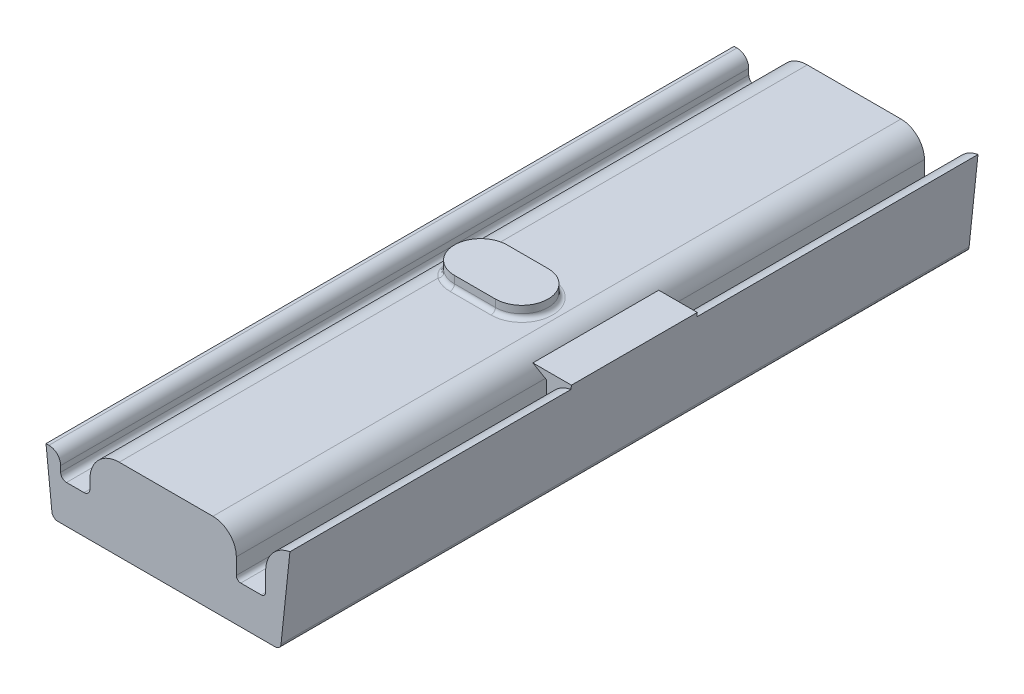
ISO-10303-21;
HEADER;
FILE_DESCRIPTION(('STEP AP214'),'2;1');
FILE_NAME('part.step','',(''),(''),'','','');
FILE_SCHEMA(('AUTOMOTIVE_DESIGN { 1 0 10303 214 1 1 1 1 }'));
ENDSEC;
DATA;
#1=APPLICATION_CONTEXT('core data for automotive mechanical design processes');
#2=APPLICATION_PROTOCOL_DEFINITION('international standard','automotive_design',2000,#1);
#3=PRODUCT_CONTEXT('',#1,'mechanical');
#4=PRODUCT('Part','Part','',(#3));
#5=PRODUCT_RELATED_PRODUCT_CATEGORY('part','',(#4));
#6=PRODUCT_DEFINITION_FORMATION('','',#4);
#7=PRODUCT_DEFINITION_CONTEXT('part definition',#1,'design');
#8=PRODUCT_DEFINITION('design','',#6,#7);
#9=PRODUCT_DEFINITION_SHAPE('','',#8);
#10=(LENGTH_UNIT() NAMED_UNIT(*) SI_UNIT(.MILLI.,.METRE.));
#11=(NAMED_UNIT(*) PLANE_ANGLE_UNIT() SI_UNIT($,.RADIAN.));
#12=(NAMED_UNIT(*) SI_UNIT($,.STERADIAN.) SOLID_ANGLE_UNIT());
#13=UNCERTAINTY_MEASURE_WITH_UNIT(LENGTH_MEASURE(1.E-05),#10,'distance_accuracy_value','');
#14=(GEOMETRIC_REPRESENTATION_CONTEXT(3) GLOBAL_UNCERTAINTY_ASSIGNED_CONTEXT((#13)) GLOBAL_UNIT_ASSIGNED_CONTEXT((#10,
#11,#12)) REPRESENTATION_CONTEXT('',''));
#15=CARTESIAN_POINT('',(0.,0.,0.));
#16=DIRECTION('',(0.,0.,1.));
#17=DIRECTION('',(1.,0.,0.));
#18=AXIS2_PLACEMENT_3D('',#15,#16,#17);
#19=CARTESIAN_POINT('',(33.35046109,14.5,117.5));
#20=DIRECTION('',(1.,0.,0.));
#21=DIRECTION('',(0.,1.,0.));
#22=AXIS2_PLACEMENT_3D('',#19,#20,#21);
#23=PLANE('',#22);
#24=DIRECTION('',(0.,0.,-1.));
#25=VECTOR('',#24,1.);
#26=CARTESIAN_POINT('',(33.35046109,29.2910379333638,21.5));
#27=LINE('',#26,#25);
#28=CARTESIAN_POINT('',(33.35046109,29.2910379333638,21.5));
#29=VERTEX_POINT('',#28);
#30=CARTESIAN_POINT('',(33.35046109,29.2910379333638,-21.5));
#31=VERTEX_POINT('',#30);
#32=EDGE_CURVE('E275',#29,#31,#27,.T.);
#33=ORIENTED_EDGE('',*,*,#32,.T.);
#34=DIRECTION('',(0.,-1.,0.));
#35=VECTOR('',#34,1.);
#36=CARTESIAN_POINT('',(33.35046109,32.,-21.5));
#37=LINE('',#36,#35);
#38=CARTESIAN_POINT('',(33.35046109,20.8,-21.4999999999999));
#39=VERTEX_POINT('',#38);
#40=EDGE_CURVE('E264',#31,#39,#37,.T.);
#41=ORIENTED_EDGE('',*,*,#40,.T.);
#42=DIRECTION('',(0.,0.,-1.));
#43=VECTOR('',#42,1.);
#44=CARTESIAN_POINT('',(33.35046109,20.8,117.5));
#45=LINE('',#44,#43);
#46=CARTESIAN_POINT('',(33.35046109,20.8,-117.5));
#47=VERTEX_POINT('',#46);
#48=EDGE_CURVE('E459',#39,#47,#45,.T.);
#49=ORIENTED_EDGE('',*,*,#48,.T.);
#50=DIRECTION('',(0.,-1.,0.));
#51=VECTOR('',#50,1.);
#52=CARTESIAN_POINT('',(33.35046109,14.5,-117.5));
#53=LINE('',#52,#51);
#54=CARTESIAN_POINT('',(33.35046109,14.5,-117.5));
#55=VERTEX_POINT('',#54);
#56=EDGE_CURVE('E345',#47,#55,#53,.T.);
#57=ORIENTED_EDGE('',*,*,#56,.T.);
#58=DIRECTION('',(0.,0.,-1.));
#59=VECTOR('',#58,1.);
#60=CARTESIAN_POINT('',(33.35046109,14.5,117.5));
#61=LINE('',#60,#59);
#62=CARTESIAN_POINT('',(33.35046109,14.5,117.5));
#63=VERTEX_POINT('',#62);
#64=EDGE_CURVE('E457',#63,#55,#61,.T.);
#65=ORIENTED_EDGE('',*,*,#64,.F.);
#66=DIRECTION('',(0.,-1.,0.));
#67=VECTOR('',#66,1.);
#68=CARTESIAN_POINT('',(33.35046109,14.5,117.5));
#69=LINE('',#68,#67);
#70=CARTESIAN_POINT('',(33.35046109,20.8,117.5));
#71=VERTEX_POINT('',#70);
#72=EDGE_CURVE('E395',#71,#63,#69,.T.);
#73=ORIENTED_EDGE('',*,*,#72,.F.);
#74=CARTESIAN_POINT('',(33.35046109,20.8,21.5));
#75=VERTEX_POINT('',#74);
#76=EDGE_CURVE('E460',#71,#75,#45,.T.);
#77=ORIENTED_EDGE('',*,*,#76,.T.);
#78=DIRECTION('',(0.,-1.,0.));
#79=VECTOR('',#78,1.);
#80=CARTESIAN_POINT('',(33.35046109,32.,21.5));
#81=LINE('',#80,#79);
#82=EDGE_CURVE('E306',#29,#75,#81,.T.);
#83=ORIENTED_EDGE('',*,*,#82,.F.);
#84=EDGE_LOOP('',(#33,#41,#49,#57,#65,#73,#77,#83));
#85=FACE_BOUND('',#84,.T.);
#86=ADVANCED_FACE('F32',(#85),#23,.F.);
#87=CARTESIAN_POINT('',(-16.64953891,18.,117.5));
#88=DIRECTION('',(0.,0.,-1.));
#89=DIRECTION('',(-1.,0.,0.));
#90=AXIS2_PLACEMENT_3D('',#87,#88,#89);
#91=CYLINDRICAL_SURFACE('',#90,10.);
#92=DIRECTION('',(0.,0.,-1.));
#93=VECTOR('',#92,1.);
#94=CARTESIAN_POINT('',(-16.64953891,28.,117.5));
#95=LINE('',#94,#93);
#96=CARTESIAN_POINT('',(-16.64953891,28.,117.5));
#97=VERTEX_POINT('',#96);
#98=CARTESIAN_POINT('',(-16.64953891,28.,8.62518003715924));
#99=VERTEX_POINT('',#98);
#100=EDGE_CURVE('E444',#97,#99,#95,.T.);
#101=ORIENTED_EDGE('',*,*,#100,.T.);
#102=CARTESIAN_POINT('',(-13.6783311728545,29.2319617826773,-8.4793219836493));
#103=CARTESIAN_POINT('',(-13.9862778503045,27.6533436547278,-8.36975964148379));
#104=CARTESIAN_POINT('',(-14.5030977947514,27.7669232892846,-9.89254231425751));
#105=CARTESIAN_POINT('',(-13.8635701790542,29.2794979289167,-8.41346337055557));
#106=CARTESIAN_POINT('',(-14.1388759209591,27.6972613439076,-8.30783891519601));
#107=CARTESIAN_POINT('',(-14.6910214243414,27.8082590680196,-9.81570726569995));
#108=CARTESIAN_POINT('',(-14.0477364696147,29.320138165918,-8.34105794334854));
#109=CARTESIAN_POINT('',(-14.2913992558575,27.7374147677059,-8.24140612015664));
#110=CARTESIAN_POINT('',(-14.8778567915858,27.8435984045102,-9.73123426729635));
#111=CARTESIAN_POINT('',(-14.4122265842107,29.3884548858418,-8.18360758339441));
#112=CARTESIAN_POINT('',(-14.596031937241,27.8101605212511,-8.09866297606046));
#113=CARTESIAN_POINT('',(-15.2476293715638,27.9030042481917,-9.5475421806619));
#114=CARTESIAN_POINT('',(-14.5925533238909,29.4161415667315,-8.0985726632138));
#115=CARTESIAN_POINT('',(-14.7477983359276,27.8427094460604,-8.02256527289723));
#116=CARTESIAN_POINT('',(-15.4305695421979,27.9270796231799,-9.44833477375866));
#117=CARTESIAN_POINT('',(-14.9469083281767,29.4593228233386,-7.91675416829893));
#118=CARTESIAN_POINT('',(-15.0497845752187,27.9002232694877,-7.86036018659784));
#119=CARTESIAN_POINT('',(-15.7900601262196,27.964628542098,-9.23621319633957));
#120=CARTESIAN_POINT('',(-15.120967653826,29.4748888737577,-7.82004341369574));
#121=CARTESIAN_POINT('',(-15.1997105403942,27.9252216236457,-7.77454363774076));
#122=CARTESIAN_POINT('',(-15.9666420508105,27.9781642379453,-9.12338398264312));
#123=CARTESIAN_POINT('',(-15.4626469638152,29.4952293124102,-7.61504876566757));
#124=CARTESIAN_POINT('',(-15.4981232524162,27.9679571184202,-7.59203488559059));
#125=CARTESIAN_POINT('',(-16.313273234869,27.9958515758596,-8.88422355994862));
#126=CARTESIAN_POINT('',(-15.6302651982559,29.5000007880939,-7.50676175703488));
#127=CARTESIAN_POINT('',(-15.6463822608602,27.9857168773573,-7.49557400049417));
#128=CARTESIAN_POINT('',(-16.4833207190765,28.0000006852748,-8.75788871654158));
#129=CARTESIAN_POINT('',(-15.9956268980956,29.4999990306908,-7.25310528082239));
#130=CARTESIAN_POINT('',(-15.9738946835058,28.0173828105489,-7.26819105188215));
#131=CARTESIAN_POINT('',(-16.8539775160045,27.9999991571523,-8.46195616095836));
#132=CARTESIAN_POINT('',(-16.1914349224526,29.4927787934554,-7.10493448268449));
#133=CARTESIAN_POINT('',(-16.1526090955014,28.0295896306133,-7.13453099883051));
#134=CARTESIAN_POINT('',(-17.0526233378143,27.9937206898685,-8.28909022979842));
#135=CARTESIAN_POINT('',(-16.5700030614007,29.4664569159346,-6.79339052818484));
#136=CARTESIAN_POINT('',(-16.5039910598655,28.043993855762,-6.85004550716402));
#137=CARTESIAN_POINT('',(-17.436677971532,27.9708321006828,-7.92562228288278));
#138=CARTESIAN_POINT('',(-16.7527547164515,29.4473476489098,-6.63000767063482));
#139=CARTESIAN_POINT('',(-16.6765299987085,28.0463047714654,-6.69959264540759));
#140=CARTESIAN_POINT('',(-17.6220782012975,27.9542153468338,-7.73500894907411));
#141=CARTESIAN_POINT('',(-17.2800304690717,29.3760764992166,-6.11842903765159));
#142=CARTESIAN_POINT('',(-17.1786847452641,28.0397933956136,-6.2253156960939));
#143=CARTESIAN_POINT('',(-18.1569956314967,27.8922404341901,-7.13816721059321));
#144=CARTESIAN_POINT('',(-17.6030835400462,29.3099838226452,-5.74914609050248));
#145=CARTESIAN_POINT('',(-17.4993524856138,28.018128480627,-5.87430724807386));
#146=CARTESIAN_POINT('',(-18.48473063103,27.8347685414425,-6.70733710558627));
#147=CARTESIAN_POINT('',(-18.1825843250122,29.1626471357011,-4.96686468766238));
#148=CARTESIAN_POINT('',(-18.0853766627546,27.952341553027,-5.11251732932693));
#149=CARTESIAN_POINT('',(-19.0726299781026,27.7066496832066,-5.79467546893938));
#150=CARTESIAN_POINT('',(-18.4393653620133,29.0814826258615,-4.55410031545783));
#151=CARTESIAN_POINT('',(-18.3529079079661,27.9088422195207,-4.70289036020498));
#152=CARTESIAN_POINT('',(-19.3331324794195,27.6360718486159,-5.31311703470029));
#153=CARTESIAN_POINT('',(-18.7723714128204,28.9633529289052,-3.90807116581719));
#154=CARTESIAN_POINT('',(-18.7045423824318,27.8395889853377,-4.04898653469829));
#155=CARTESIAN_POINT('',(-19.6709647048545,27.5333503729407,-4.55941636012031));
#156=CARTESIAN_POINT('',(-18.8747020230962,28.9245681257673,-3.68817774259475));
#157=CARTESIAN_POINT('',(-18.813048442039,27.8159946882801,-3.82593716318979));
#158=CARTESIAN_POINT('',(-19.7747783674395,27.4996244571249,-4.30287403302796));
#159=CARTESIAN_POINT('',(-19.0613996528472,28.8504902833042,-3.2405121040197));
#160=CARTESIAN_POINT('',(-19.011789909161,27.7697468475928,-3.36943752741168));
#161=CARTESIAN_POINT('',(-19.9641817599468,27.4352089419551,-3.78059745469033));
#162=CARTESIAN_POINT('',(-19.1457734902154,28.8151959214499,-3.01274291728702));
#163=CARTESIAN_POINT('',(-19.1023442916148,27.7470508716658,-3.13575747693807));
#164=CARTESIAN_POINT('',(-20.0497784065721,27.4045181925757,-3.51486673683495));
#165=CARTESIAN_POINT('',(-19.2998588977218,28.7485456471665,-2.53861431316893));
#166=CARTESIAN_POINT('',(-19.2680611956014,27.7034828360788,-2.64754042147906));
#167=CARTESIAN_POINT('',(-20.2060969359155,27.3465614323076,-2.96171669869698));
#168=CARTESIAN_POINT('',(-19.3685849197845,28.7174883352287,-2.29190300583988));
#169=CARTESIAN_POINT('',(-19.3425392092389,27.6826916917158,-2.39206996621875));
#170=CARTESIAN_POINT('',(-20.2758189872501,27.3195550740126,-2.67388684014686));
#171=CARTESIAN_POINT('',(-19.4848654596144,28.6637101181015,-1.79286187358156));
#172=CARTESIAN_POINT('',(-19.4686367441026,27.6463467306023,-1.87405287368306));
#173=CARTESIAN_POINT('',(-20.3937847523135,27.272791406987,-2.09167218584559));
#174=CARTESIAN_POINT('',(-19.5324195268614,28.6409893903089,-1.54053192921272));
#175=CARTESIAN_POINT('',(-19.5205213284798,27.6307245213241,-1.61101570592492));
#176=CARTESIAN_POINT('',(-20.4420280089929,27.2530342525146,-1.79728725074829));
#177=CARTESIAN_POINT('',(-19.6058007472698,28.6054976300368,-1.03239512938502));
#178=CARTESIAN_POINT('',(-19.6005243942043,27.6062343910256,-1.0807842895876));
#179=CARTESIAN_POINT('',(-20.5164727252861,27.2221718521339,-1.20446098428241));
#180=CARTESIAN_POINT('',(-19.6316432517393,28.5927195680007,-0.776590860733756));
#181=CARTESIAN_POINT('',(-19.628837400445,27.5973092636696,-0.813027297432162));
#182=CARTESIAN_POINT('',(-20.5426897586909,27.211060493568,-0.906022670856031));
#183=CARTESIAN_POINT('',(-19.6613394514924,28.5780104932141,-0.263489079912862));
#184=CARTESIAN_POINT('',(-19.6613042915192,27.5870510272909,-0.276119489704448));
#185=CARTESIAN_POINT('',(-20.5728163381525,27.1982699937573,-0.307403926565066));
#186=CARTESIAN_POINT('',(-19.6651948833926,28.5760786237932,-0.00619168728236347));
#187=CARTESIAN_POINT('',(-19.6655344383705,27.5856938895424,-0.00635813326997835));
#188=CARTESIAN_POINT('',(-20.5767276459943,27.1965901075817,-0.00722363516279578));
#189=CARTESIAN_POINT('',(-19.6513948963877,28.5829364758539,0.489016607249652));
#190=CARTESIAN_POINT('',(-19.6504427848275,27.5904828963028,0.512025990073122));
#191=CARTESIAN_POINT('',(-20.5627276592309,27.2025534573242,0.570519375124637));
#192=CARTESIAN_POINT('',(-19.6352794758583,28.5909586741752,0.726979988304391));
#193=CARTESIAN_POINT('',(-19.6327776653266,27.5961012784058,0.76128744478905));
#194=CARTESIAN_POINT('',(-20.5463786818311,27.2095292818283,0.848143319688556));
#195=CARTESIAN_POINT('',(-19.5842780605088,28.6159387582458,1.2005221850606));
#196=CARTESIAN_POINT('',(-19.5770905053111,27.6134368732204,1.25614930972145));
#197=CARTESIAN_POINT('',(-20.4946381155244,27.2312510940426,1.40060921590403));
#198=CARTESIAN_POINT('',(-19.5493928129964,28.6328962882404,1.43610109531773));
#199=CARTESIAN_POINT('',(-19.5389612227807,27.625186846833,1.5022196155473));
#200=CARTESIAN_POINT('',(-20.459247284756,27.2459967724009,1.67545127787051));
#201=CARTESIAN_POINT('',(-19.4611779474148,28.6747217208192,1.9033379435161));
#202=CARTESIAN_POINT('',(-19.4430133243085,27.6537842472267,1.98863114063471));
#203=CARTESIAN_POINT('',(-20.3697539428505,27.2823667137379,2.2205609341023));
#204=CARTESIAN_POINT('',(-19.4078421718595,28.699592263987,2.13499454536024));
#205=CARTESIAN_POINT('',(-19.3850091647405,27.6706831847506,2.22939403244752));
#206=CARTESIAN_POINT('',(-20.3156451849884,27.3039932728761,2.49082696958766));
#207=CARTESIAN_POINT('',(-19.2832112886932,28.7557466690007,2.59286915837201));
#208=CARTESIAN_POINT('',(-19.2502818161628,27.7081632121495,2.70324819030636));
#209=CARTESIAN_POINT('',(-20.1892080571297,27.3528231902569,3.02501401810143));
#210=CARTESIAN_POINT('',(-19.2119091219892,28.7870330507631,2.81908499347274));
#211=CARTESIAN_POINT('',(-19.1733157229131,27.7288014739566,2.93669248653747));
#212=CARTESIAN_POINT('',(-20.1168725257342,27.3800287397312,3.28893249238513));
#213=CARTESIAN_POINT('',(-18.9710230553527,28.8881889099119,3.48974829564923));
#214=CARTESIAN_POINT('',(-18.9140486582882,27.7941691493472,3.62776150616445));
#215=CARTESIAN_POINT('',(-19.8724953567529,27.4679903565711,4.07137301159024));
#216=CARTESIAN_POINT('',(-18.7748472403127,28.9651458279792,3.92417441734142));
#217=CARTESIAN_POINT('',(-18.7041768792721,27.8419784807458,4.07005415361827));
#218=CARTESIAN_POINT('',(-19.6734764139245,27.5349094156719,4.57820348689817));
#219=CARTESIAN_POINT('',(-18.3167603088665,29.1204970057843,4.75642523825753));
#220=CARTESIAN_POINT('',(-18.2256520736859,27.9299549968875,4.90403165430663));
#221=CARTESIAN_POINT('',(-19.2087505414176,27.6699973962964,5.54916277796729));
#222=CARTESIAN_POINT('',(-18.0548323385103,29.1988916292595,5.15424051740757));
#223=CARTESIAN_POINT('',(-17.9546114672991,27.9701394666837,5.29637945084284));
#224=CARTESIAN_POINT('',(-18.9430265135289,27.7381666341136,6.01328060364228));
#225=CARTESIAN_POINT('',(-17.4846483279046,29.3344176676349,5.88631795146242));
#226=CARTESIAN_POINT('',(-17.3823617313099,28.0264230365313,6.00457337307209));
#227=CARTESIAN_POINT('',(-18.3645789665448,27.8560153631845,6.86737094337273));
#228=CARTESIAN_POINT('',(-17.1793999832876,29.3924229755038,6.2227750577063));
#229=CARTESIAN_POINT('',(-17.0815712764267,28.0431834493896,6.32285744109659));
#230=CARTESIAN_POINT('',(-18.0549067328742,27.9064547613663,7.25990423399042));
#231=CARTESIAN_POINT('',(-16.6853651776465,29.4545266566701,6.69065993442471));
#232=CARTESIAN_POINT('',(-16.6129955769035,28.0455842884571,6.7554073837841));
#233=CARTESIAN_POINT('',(-17.5537120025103,27.9604579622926,7.80576992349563));
#234=CARTESIAN_POINT('',(-16.5147606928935,29.4710749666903,6.84041786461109));
#235=CARTESIAN_POINT('',(-16.4525259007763,28.042463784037,6.89301670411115));
#236=CARTESIAN_POINT('',(-17.3806349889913,27.9748477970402,7.98048750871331));
#237=CARTESIAN_POINT('',(-16.1624378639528,29.4938088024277,7.12681046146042));
#238=CARTESIAN_POINT('',(-16.1263067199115,28.0277691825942,7.15415037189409));
#239=CARTESIAN_POINT('',(-17.023206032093,27.9946163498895,8.31461220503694));
#240=CARTESIAN_POINT('',(-15.9807251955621,29.4999995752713,7.26345173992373));
#241=CARTESIAN_POINT('',(-15.9606684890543,28.0161051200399,7.27737395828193));
#242=CARTESIAN_POINT('',(-16.8388598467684,27.9999996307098,8.47402702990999));
#243=CARTESIAN_POINT('',(-15.6302741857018,29.5000003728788,7.5067548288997));
#244=CARTESIAN_POINT('',(-15.6463929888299,27.9857169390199,7.49556626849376));
#245=CARTESIAN_POINT('',(-16.4833298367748,28.0000003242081,8.75788063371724));
#246=CARTESIAN_POINT('',(-15.4626600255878,29.4952295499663,7.61504010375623));
#247=CARTESIAN_POINT('',(-15.4981355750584,27.9679582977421,7.59202672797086));
#248=CARTESIAN_POINT('',(-16.3132864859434,27.9958517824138,8.88421345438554));
#249=CARTESIAN_POINT('',(-15.1209830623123,29.4748903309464,7.82003499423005));
#250=CARTESIAN_POINT('',(-15.1997230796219,27.9252240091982,7.77453659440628));
#251=CARTESIAN_POINT('',(-15.9666576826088,27.9781655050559,9.1233741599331));
#252=CARTESIAN_POINT('',(-14.946921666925,29.4593242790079,7.91674711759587));
#253=CARTESIAN_POINT('',(-15.0497957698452,27.900225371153,7.86035404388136));
#254=CARTESIAN_POINT('',(-15.7900736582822,27.9646298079,9.23620497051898));
#255=CARTESIAN_POINT('',(-14.5925583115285,29.4161423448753,8.09857031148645));
#256=CARTESIAN_POINT('',(-14.7478027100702,27.842710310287,8.02256305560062));
#257=CARTESIAN_POINT('',(-15.4305746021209,27.9270802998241,9.44833203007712));
#258=CARTESIAN_POINT('',(-14.4122251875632,29.38845476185,8.1836083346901));
#259=CARTESIAN_POINT('',(-14.5960308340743,27.8101602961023,8.09866357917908));
#260=CARTESIAN_POINT('',(-15.247627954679,27.9030041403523,9.54754305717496));
#261=CARTESIAN_POINT('',(-14.0477310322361,29.3201370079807,8.34106014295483));
#262=CARTESIAN_POINT('',(-14.2913946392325,27.7374136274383,8.24140819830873));
#263=CARTESIAN_POINT('',(-14.8778512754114,27.843597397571,9.73123683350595));
#264=CARTESIAN_POINT('',(-13.8635672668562,29.279497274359,8.41346453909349));
#265=CARTESIAN_POINT('',(-14.138873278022,27.6972607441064,8.30784013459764));
#266=CARTESIAN_POINT('',(-14.691018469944,27.8082584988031,9.81570862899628));
#267=CARTESIAN_POINT('',(-13.6783311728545,29.2319617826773,8.4793219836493));
#268=CARTESIAN_POINT('',(-13.9862778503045,27.6533436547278,8.36975964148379));
#269=CARTESIAN_POINT('',(-14.5030977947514,27.7669232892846,9.89254231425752));
#270=(BOUNDED_SURFACE() B_SPLINE_SURFACE(3,2,((#102,#103,#104),(#105,#106,#107),(#108,#109,
#110),(#111,#112,#113),(#114,#115,#116),(#117,#118,#119),(#120,#121,#122),(#123,#124,#125),
(#126,#127,#128),(#129,#130,#131),(#132,#133,#134),(#135,#136,#137),(#138,#139,#140),(#141,#142,
#143),(#144,#145,#146),(#147,#148,#149),(#150,#151,#152),(#153,#154,#155),(#156,#157,#158),
(#159,#160,#161),(#162,#163,#164),(#165,#166,#167),(#168,#169,#170),(#171,#172,#173),(#174,#175,
#176),(#177,#178,#179),(#180,#181,#182),(#183,#184,#185),(#186,#187,#188),(#189,#190,#191),
(#192,#193,#194),(#195,#196,#197),(#198,#199,#200),(#201,#202,#203),(#204,#205,#206),(#207,#208,
#209),(#210,#211,#212),(#213,#214,#215),(#216,#217,#218),(#219,#220,#221),(#222,#223,#224),
(#225,#226,#227),(#228,#229,#230),(#231,#232,#233),(#234,#235,#236),(#237,#238,#239),(#240,#241,
#242),(#243,#244,#245),(#246,#247,#248),(#249,#250,#251),(#252,#253,#254),(#255,#256,#257),
(#258,#259,#260),(#261,#262,#263),(#264,#265,#266),(#267,#268,#269)),.UNSPECIFIED.,.F.,.F.,
.F.) B_SPLINE_SURFACE_WITH_KNOTS((4,2,2,2,2,2,2,2,2,2,2,2,2,2,2,2,2,2,2,2,2,2,2,2,2,2,2,4),(3,
3),(0.,0.702419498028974,1.40428506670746,2.10197975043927,2.79986266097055,3.65821762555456,
4.51712378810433,6.23700507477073,7.94805958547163,8.80410015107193,9.65981510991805,
10.5598432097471,11.4598904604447,12.3593007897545,13.2586400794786,14.0927460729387,
14.9268188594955,15.7611702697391,16.5958500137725,18.2724098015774,19.9493997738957,
21.5416983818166,22.336997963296,23.1318945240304,23.8297519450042,24.5274578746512,
25.2293478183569,25.9317571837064),(0.,1.),
.UNSPECIFIED.) GEOMETRIC_REPRESENTATION_ITEM() RATIONAL_B_SPLINE_SURFACE(((1.,0.68119425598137,
1.),(1.,0.681878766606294,1.),(1.,0.682995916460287,1.),(1.,0.68600691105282,1.),(1.,
0.687900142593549,1.),(1.,0.692362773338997,1.),(1.,0.694928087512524,1.),(1.,0.700624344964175,
1.),(1.,0.703755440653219,1.),(1.,0.711228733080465,1.),(1.,0.715683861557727,1.),(1.,
0.725022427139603,1.),(1.,0.729906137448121,1.),(1.,0.744868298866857,1.),(1.,0.755246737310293,
1.),(1.,0.775159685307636,1.),(1.,0.784698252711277,1.),(1.,0.797556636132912,1.),(1.,
0.801602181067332,1.),(1.,0.809101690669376,1.),(1.,0.812555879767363,1.),(1.,0.818936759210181,
1.),(1.,0.821826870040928,1.),(1.,0.826755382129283,1.),(1.,0.828793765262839,1.),(1.,
0.831952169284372,1.),(1.,0.833072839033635,1.),(1.,0.834361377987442,1.),(1.,0.834529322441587,
1.),(1.,0.833929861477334,1.),(1.,0.833229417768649,1.),(1.,0.831024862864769,1.),(1.,
0.829520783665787,1.),(1.,0.825749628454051,1.),(1.,0.823482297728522,1.),(1.,0.818247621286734,
1.),(1.,0.815280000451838,1.),(1.,0.805406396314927,1.),(1.,0.79754711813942,1.),(1.,
0.780141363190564,1.),(1.,0.770594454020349,1.),(1.,0.751441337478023,1.),(1.,0.741862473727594,
1.),(1.,0.728098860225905,1.),(1.,0.723614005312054,1.),(1.,0.715026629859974,1.),(1.,
0.710923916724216,1.),(1.,0.70375563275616,1.),(1.,0.700624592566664,1.),(1.,0.694928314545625,
1.),(1.,0.692362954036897,1.),(1.,0.687900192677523,1.),(1.,0.686006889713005,1.),(1.,
0.682995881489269,1.),(1.,0.681878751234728,1.),(1.,0.681194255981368,1.))) REPRESENTATION_ITEM('') SURFACE());
#271=CARTESIAN_POINT('',(-14.5030977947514,27.7669232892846,9.89254231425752));
#272=CARTESIAN_POINT('',(-14.691018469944,27.8082584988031,9.81570862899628));
#273=CARTESIAN_POINT('',(-14.8778512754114,27.843597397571,9.73123683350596));
#274=CARTESIAN_POINT('',(-15.247627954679,27.9030041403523,9.54754305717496));
#275=CARTESIAN_POINT('',(-15.4305746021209,27.9270802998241,9.44833203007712));
#276=CARTESIAN_POINT('',(-15.7900736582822,27.9646298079,9.23620497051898));
#277=CARTESIAN_POINT('',(-15.9666576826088,27.9781655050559,9.1233741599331));
#278=CARTESIAN_POINT('',(-16.3132864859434,27.9958517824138,8.88421345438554));
#279=CARTESIAN_POINT('',(-16.4833298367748,28.0000003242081,8.75788063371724));
#280=CARTESIAN_POINT('',(-16.8388598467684,27.9999996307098,8.47402702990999));
#281=CARTESIAN_POINT('',(-17.023206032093,27.9946163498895,8.31461220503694));
#282=CARTESIAN_POINT('',(-17.3806349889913,27.9748477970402,7.98048750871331));
#283=CARTESIAN_POINT('',(-17.5537120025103,27.9604579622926,7.80576992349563));
#284=CARTESIAN_POINT('',(-18.0549067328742,27.9064547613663,7.25990423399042));
#285=CARTESIAN_POINT('',(-18.3645789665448,27.8560153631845,6.86737094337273));
#286=CARTESIAN_POINT('',(-18.9430265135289,27.7381666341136,6.01328060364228));
#287=CARTESIAN_POINT('',(-19.2087505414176,27.6699973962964,5.54916277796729));
#288=CARTESIAN_POINT('',(-19.6734764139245,27.5349094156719,4.57820348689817));
#289=CARTESIAN_POINT('',(-19.8724953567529,27.4679903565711,4.07137301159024));
#290=CARTESIAN_POINT('',(-20.1168725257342,27.3800287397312,3.28893249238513));
#291=CARTESIAN_POINT('',(-20.1892080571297,27.3528231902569,3.02501401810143));
#292=CARTESIAN_POINT('',(-20.3156451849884,27.3039932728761,2.49082696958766));
#293=CARTESIAN_POINT('',(-20.3697539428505,27.2823667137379,2.2205609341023));
#294=CARTESIAN_POINT('',(-20.459247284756,27.2459967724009,1.67545127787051));
#295=CARTESIAN_POINT('',(-20.4946381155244,27.2312510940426,1.40060921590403));
#296=CARTESIAN_POINT('',(-20.5463786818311,27.2095292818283,0.848143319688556));
#297=CARTESIAN_POINT('',(-20.5627276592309,27.2025534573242,0.570519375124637));
#298=CARTESIAN_POINT('',(-20.5767276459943,27.1965901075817,-0.007223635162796));
#299=CARTESIAN_POINT('',(-20.5728163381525,27.1982699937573,-0.307403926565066));
#300=CARTESIAN_POINT('',(-20.5426897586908,27.211060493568,-0.90602267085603));
#301=CARTESIAN_POINT('',(-20.5164727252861,27.2221718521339,-1.20446098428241));
#302=CARTESIAN_POINT('',(-20.4420280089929,27.2530342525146,-1.79728725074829));
#303=CARTESIAN_POINT('',(-20.3937847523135,27.272791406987,-2.09167218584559));
#304=CARTESIAN_POINT('',(-20.2758189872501,27.3195550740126,-2.67388684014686));
#305=CARTESIAN_POINT('',(-20.2060969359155,27.3465614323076,-2.96171669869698));
#306=CARTESIAN_POINT('',(-20.0497784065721,27.4045181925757,-3.51486673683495));
#307=CARTESIAN_POINT('',(-19.9641817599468,27.435208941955,-3.78059745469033));
#308=CARTESIAN_POINT('',(-19.7747783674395,27.4996244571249,-4.30287403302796));
#309=CARTESIAN_POINT('',(-19.6709647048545,27.5333503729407,-4.55941636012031));
#310=CARTESIAN_POINT('',(-19.3331324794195,27.6360718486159,-5.31311703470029));
#311=CARTESIAN_POINT('',(-19.0726299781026,27.7066496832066,-5.79467546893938));
#312=CARTESIAN_POINT('',(-18.48473063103,27.8347685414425,-6.70733710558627));
#313=CARTESIAN_POINT('',(-18.1569956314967,27.8922404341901,-7.13816721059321));
#314=CARTESIAN_POINT('',(-17.6220782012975,27.9542153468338,-7.73500894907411));
#315=CARTESIAN_POINT('',(-17.436677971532,27.9708321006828,-7.92562228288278));
#316=CARTESIAN_POINT('',(-17.0526233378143,27.9937206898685,-8.28909022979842));
#317=CARTESIAN_POINT('',(-16.8539775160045,27.9999991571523,-8.46195616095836));
#318=CARTESIAN_POINT('',(-16.4833207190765,28.0000006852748,-8.75788871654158));
#319=CARTESIAN_POINT('',(-16.313273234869,27.9958515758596,-8.88422355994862));
#320=CARTESIAN_POINT('',(-15.9666420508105,27.9781642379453,-9.12338398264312));
#321=CARTESIAN_POINT('',(-15.7900601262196,27.964628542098,-9.23621319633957));
#322=CARTESIAN_POINT('',(-15.4305695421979,27.9270796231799,-9.44833477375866));
#323=CARTESIAN_POINT('',(-15.2476293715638,27.9030042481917,-9.5475421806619));
#324=CARTESIAN_POINT('',(-14.8778567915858,27.8435984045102,-9.73123426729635));
#325=CARTESIAN_POINT('',(-14.6910214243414,27.8082590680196,-9.81570726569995));
#326=CARTESIAN_POINT('',(-14.5030977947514,27.7669232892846,-9.89254231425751));
#327=B_SPLINE_CURVE_WITH_KNOTS('',3,(#271,#272,#273,#274,#275,#276,#277,#278,#279,#280,#281,
#282,#283,#284,#285,#286,#287,#288,#289,#290,#291,#292,#293,#294,#295,#296,#297,#298,#299,#300,
#301,#302,#303,#304,#305,#306,#307,#308,#309,#310,#311,#312,#313,#314,#315,#316,#317,#318,#319,
#320,#321,#322,#323,#324,#325,#326),.UNSPECIFIED.,.F.,.F.,(4,2,2,2,2,2,2,2,2,2,2,2,2,2,2,2,2,2,
2,2,2,2,2,2,2,2,2,4),(0.,0.70240936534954,1.40429930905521,2.10200523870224,2.79986265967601,
3.59475922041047,4.39005880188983,5.98235740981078,7.65934738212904,9.33590716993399,
10.1705869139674,11.0049383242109,11.8390111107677,12.6731171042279,13.572456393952,
14.4718667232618,15.3719139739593,16.2719420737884,17.1276570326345,17.9836975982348,
19.6947521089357,21.4146333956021,22.2735395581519,23.1318945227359,23.8297774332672,
24.527472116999,25.2293376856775,25.9317571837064),.UNSPECIFIED.);
#328=CARTESIAN_POINT('',(-16.64953891,28.,-8.62518003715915));
#329=VERTEX_POINT('',#328);
#330=EDGE_CURVE('E41',#99,#329,#327,.T.);
#331=ORIENTED_EDGE('',*,*,#330,.T.);
#332=CARTESIAN_POINT('',(-16.64953891,28.,-117.5));
#333=VERTEX_POINT('',#332);
#334=EDGE_CURVE('E443',#329,#333,#95,.T.);
#335=ORIENTED_EDGE('',*,*,#334,.T.);
#336=CARTESIAN_POINT('',(-16.64953891,18.,-117.5));
#337=DIRECTION('',(0.,0.,1.));
#338=DIRECTION('',(-1.,0.,0.));
#339=AXIS2_PLACEMENT_3D('',#336,#337,#338);
#340=CIRCLE('',#339,10.);
#341=CARTESIAN_POINT('',(-26.64953891,18.,-117.5));
#342=VERTEX_POINT('',#341);
#343=EDGE_CURVE('E366',#333,#342,#340,.T.);
#344=ORIENTED_EDGE('',*,*,#343,.T.);
#345=DIRECTION('',(0.,0.,-1.));
#346=VECTOR('',#345,1.);
#347=CARTESIAN_POINT('',(-26.64953891,18.,117.5));
#348=LINE('',#347,#346);
#349=CARTESIAN_POINT('',(-26.64953891,18.,117.5));
#350=VERTEX_POINT('',#349);
#351=EDGE_CURVE('E441',#350,#342,#348,.T.);
#352=ORIENTED_EDGE('',*,*,#351,.F.);
#353=CARTESIAN_POINT('',(-16.64953891,18.,117.5));
#354=DIRECTION('',(0.,0.,1.));
#355=DIRECTION('',(-1.,0.,0.));
#356=AXIS2_PLACEMENT_3D('',#353,#354,#355);
#357=CIRCLE('',#356,10.);
#358=EDGE_CURVE('E409',#97,#350,#357,.T.);
#359=ORIENTED_EDGE('',*,*,#358,.F.);
#360=EDGE_LOOP('',(#101,#331,#335,#344,#352,#359));
#361=FACE_BOUND('',#360,.T.);
#362=ADVANCED_FACE('F530',(#361),#91,.T.);
#363=CARTESIAN_POINT('',(43.35046109,20.8,117.5));
#364=DIRECTION('',(0.,0.,-1.));
#365=DIRECTION('',(-1.,0.,0.));
#366=AXIS2_PLACEMENT_3D('',#363,#364,#365);
#367=CYLINDRICAL_SURFACE('',#366,10.);
#368=CARTESIAN_POINT('',(43.35046109,20.8,-21.5));
#369=DIRECTION('',(0.,0.,-1.));
#370=DIRECTION('',(1.,0.,0.));
#371=AXIS2_PLACEMENT_3D('',#368,#369,#370);
#372=CIRCLE('',#371,10.);
#373=CARTESIAN_POINT('',(41.64953891,30.6542814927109,-21.5));
#374=VERTEX_POINT('',#373);
#375=EDGE_CURVE('E274',#39,#374,#372,.T.);
#376=ORIENTED_EDGE('',*,*,#375,.T.);
#377=DIRECTION('',(0.,0.,-1.));
#378=VECTOR('',#377,1.);
#379=CARTESIAN_POINT('',(41.64953891,30.6542814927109,117.5));
#380=LINE('',#379,#378);
#381=CARTESIAN_POINT('',(41.64953891,30.6542814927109,-117.5));
#382=VERTEX_POINT('',#381);
#383=EDGE_CURVE('E463',#374,#382,#380,.T.);
#384=ORIENTED_EDGE('',*,*,#383,.T.);
#385=CARTESIAN_POINT('',(43.35046109,20.8,-117.5));
#386=DIRECTION('',(0.,0.,1.));
#387=DIRECTION('',(1.,0.,0.));
#388=AXIS2_PLACEMENT_3D('',#385,#386,#387);
#389=CIRCLE('',#388,10.);
#390=EDGE_CURVE('E342',#382,#47,#389,.T.);
#391=ORIENTED_EDGE('',*,*,#390,.T.);
#392=ORIENTED_EDGE('',*,*,#48,.F.);
#393=EDGE_LOOP('',(#376,#384,#391,#392));
#394=FACE_BOUND('',#393,.T.);
#395=ADVANCED_FACE('F535',(#394),#367,.T.);
#396=CARTESIAN_POINT('',(-16.64953891,28.,117.5));
#397=DIRECTION('',(0.,-1.,0.));
#398=DIRECTION('',(1.,0.,0.));
#399=AXIS2_PLACEMENT_3D('',#396,#397,#398);
#400=PLANE('',#399);
#401=DIRECTION('',(1.,0.,0.));
#402=VECTOR('',#401,1.);
#403=CARTESIAN_POINT('',(-10.661528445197,28.,10.5));
#404=LINE('',#403,#402);
#405=CARTESIAN_POINT('',(3.33847155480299,28.,10.5));
#406=VERTEX_POINT('',#405);
#407=CARTESIAN_POINT('',(-10.661528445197,28.,10.5));
#408=VERTEX_POINT('',#407);
#409=EDGE_CURVE('E494',#406,#408,#404,.F.);
#410=ORIENTED_EDGE('',*,*,#409,.T.);
#411=CARTESIAN_POINT('',(-10.661528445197,28.,0.));
#412=DIRECTION('',(0.,-1.,0.));
#413=DIRECTION('',(1.,0.,0.));
#414=AXIS2_PLACEMENT_3D('',#411,#412,#413);
#415=CIRCLE('',#414,10.5);
#416=EDGE_CURVE('E496',#408,#99,#415,.T.);
#417=ORIENTED_EDGE('',*,*,#416,.T.);
#418=ORIENTED_EDGE('',*,*,#100,.F.);
#419=DIRECTION('',(-1.,0.,0.));
#420=VECTOR('',#419,1.);
#421=CARTESIAN_POINT('',(-16.64953891,28.,117.5));
#422=LINE('',#421,#420);
#423=CARTESIAN_POINT('',(15.35046109,28.,117.5));
#424=VERTEX_POINT('',#423);
#425=EDGE_CURVE('E407',#424,#97,#422,.T.);
#426=ORIENTED_EDGE('',*,*,#425,.F.);
#427=DIRECTION('',(0.,0.,-1.));
#428=VECTOR('',#427,1.);
#429=CARTESIAN_POINT('',(15.35046109,28.,117.5));
#430=LINE('',#429,#428);
#431=CARTESIAN_POINT('',(15.35046109,28.,-117.5));
#432=VERTEX_POINT('',#431);
#433=EDGE_CURVE('E447',#424,#432,#430,.T.);
#434=ORIENTED_EDGE('',*,*,#433,.T.);
#435=DIRECTION('',(-1.,0.,0.));
#436=VECTOR('',#435,1.);
#437=CARTESIAN_POINT('',(-16.64953891,28.,-117.5));
#438=LINE('',#437,#436);
#439=EDGE_CURVE('E363',#432,#333,#438,.T.);
#440=ORIENTED_EDGE('',*,*,#439,.T.);
#441=ORIENTED_EDGE('',*,*,#334,.F.);
#442=CARTESIAN_POINT('',(-10.661528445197,28.,0.));
#443=DIRECTION('',(0.,-1.,0.));
#444=DIRECTION('',(1.,0.,0.));
#445=AXIS2_PLACEMENT_3D('',#442,#443,#444);
#446=CIRCLE('',#445,10.5);
#447=CARTESIAN_POINT('',(-10.661528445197,28.,-10.5));
#448=VERTEX_POINT('',#447);
#449=EDGE_CURVE('E489',#329,#448,#446,.T.);
#450=ORIENTED_EDGE('',*,*,#449,.T.);
#451=DIRECTION('',(-1.,0.,0.));
#452=VECTOR('',#451,1.);
#453=CARTESIAN_POINT('',(3.33847155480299,28.,-10.5));
#454=LINE('',#453,#452);
#455=CARTESIAN_POINT('',(3.33847155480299,28.,-10.5));
#456=VERTEX_POINT('',#455);
#457=EDGE_CURVE('E487',#448,#456,#454,.F.);
#458=ORIENTED_EDGE('',*,*,#457,.T.);
#459=CARTESIAN_POINT('',(3.33847155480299,28.,0.));
#460=DIRECTION('',(0.,-1.,0.));
#461=DIRECTION('',(1.,0.,0.));
#462=AXIS2_PLACEMENT_3D('',#459,#460,#461);
#463=CIRCLE('',#462,10.5);
#464=EDGE_CURVE('E491',#456,#406,#463,.T.);
#465=ORIENTED_EDGE('',*,*,#464,.T.);
#466=EDGE_LOOP('',(#410,#417,#418,#426,#434,#440,#441,#450,#458,#465));
#467=FACE_BOUND('',#466,.T.);
#468=ADVANCED_FACE('F539',(#467),#400,.F.);
#469=CARTESIAN_POINT('',(-41.64953891,0.,117.5));
#470=DIRECTION('',(0.,1.,0.));
#471=DIRECTION('',(0.,0.,1.));
#472=AXIS2_PLACEMENT_3D('',#469,#470,#471);
#473=PLANE('',#472);
#474=DIRECTION('',(1.,0.,0.));
#475=VECTOR('',#474,1.);
#476=CARTESIAN_POINT('',(-41.64953891,0.,117.5));
#477=LINE('',#476,#475);
#478=CARTESIAN_POINT('',(-37.6415418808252,0.,117.5));
#479=VERTEX_POINT('',#478);
#480=CARTESIAN_POINT('',(36.6268360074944,0.,117.5));
#481=VERTEX_POINT('',#480);
#482=EDGE_CURVE('E390',#479,#481,#477,.T.);
#483=ORIENTED_EDGE('',*,*,#482,.F.);
#484=DIRECTION('',(0.,0.,1.));
#485=VECTOR('',#484,1.);
#486=CARTESIAN_POINT('',(-37.6415418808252,0.,117.5));
#487=LINE('',#486,#485);
#488=CARTESIAN_POINT('',(-37.6415418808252,0.,-117.5));
#489=VERTEX_POINT('',#488);
#490=EDGE_CURVE('E476',#479,#489,#487,.F.);
#491=ORIENTED_EDGE('',*,*,#490,.T.);
#492=DIRECTION('',(1.,0.,0.));
#493=VECTOR('',#492,1.);
#494=CARTESIAN_POINT('',(-41.64953891,0.,-117.5));
#495=LINE('',#494,#493);
#496=CARTESIAN_POINT('',(36.6268360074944,0.,-117.5));
#497=VERTEX_POINT('',#496);
#498=EDGE_CURVE('E339',#489,#497,#495,.T.);
#499=ORIENTED_EDGE('',*,*,#498,.T.);
#500=DIRECTION('',(0.,0.,1.));
#501=VECTOR('',#500,1.);
#502=CARTESIAN_POINT('',(36.6268360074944,0.,117.5));
#503=LINE('',#502,#501);
#504=EDGE_CURVE('E473',#497,#481,#503,.T.);
#505=ORIENTED_EDGE('',*,*,#504,.T.);
#506=EDGE_LOOP('',(#483,#491,#499,#505));
#507=FACE_BOUND('',#506,.T.);
#508=ADVANCED_FACE('F657',(#507),#473,.F.);
#509=CARTESIAN_POINT('',(41.64953891,30.6542814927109,117.5));
#510=VERTEX_POINT('',#509);
#511=CARTESIAN_POINT('',(41.64953891,30.6542814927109,21.5));
#512=VERTEX_POINT('',#511);
#513=EDGE_CURVE('E464',#510,#512,#380,.T.);
#514=ORIENTED_EDGE('',*,*,#513,.T.);
#515=CARTESIAN_POINT('',(43.35046109,20.8,21.5));
#516=DIRECTION('',(0.,0.,-1.));
#517=DIRECTION('',(1.,0.,0.));
#518=AXIS2_PLACEMENT_3D('',#515,#516,#517);
#519=CIRCLE('',#518,10.);
#520=EDGE_CURVE('E299',#75,#512,#519,.T.);
#521=ORIENTED_EDGE('',*,*,#520,.F.);
#522=ORIENTED_EDGE('',*,*,#76,.F.);
#523=CARTESIAN_POINT('',(43.35046109,20.8,117.5));
#524=DIRECTION('',(0.,0.,1.));
#525=DIRECTION('',(1.,0.,0.));
#526=AXIS2_PLACEMENT_3D('',#523,#524,#525);
#527=CIRCLE('',#526,10.);
#528=EDGE_CURVE('E393',#510,#71,#527,.T.);
#529=ORIENTED_EDGE('',*,*,#528,.F.);
#530=EDGE_LOOP('',(#514,#521,#522,#529));
#531=FACE_BOUND('',#530,.T.);
#532=ADVANCED_FACE('F707',(#531),#367,.T.);
#533=CARTESIAN_POINT('',(31.85046109,14.5,117.5));
#534=DIRECTION('',(0.,0.,-1.));
#535=DIRECTION('',(-1.,0.,0.));
#536=AXIS2_PLACEMENT_3D('',#533,#534,#535);
#537=CYLINDRICAL_SURFACE('',#536,1.5);
#538=ORIENTED_EDGE('',*,*,#64,.T.);
#539=CARTESIAN_POINT('',(31.85046109,14.5,-117.5));
#540=DIRECTION('',(0.,0.,-1.));
#541=DIRECTION('',(-1.,0.,0.));
#542=AXIS2_PLACEMENT_3D('',#539,#540,#541);
#543=CIRCLE('',#542,1.5);
#544=CARTESIAN_POINT('',(31.85046109,13.,-117.5));
#545=VERTEX_POINT('',#544);
#546=EDGE_CURVE('E348',#55,#545,#543,.T.);
#547=ORIENTED_EDGE('',*,*,#546,.T.);
#548=DIRECTION('',(0.,0.,-1.));
#549=VECTOR('',#548,1.);
#550=CARTESIAN_POINT('',(31.85046109,13.,117.5));
#551=LINE('',#550,#549);
#552=CARTESIAN_POINT('',(31.85046109,13.,117.5));
#553=VERTEX_POINT('',#552);
#554=EDGE_CURVE('E455',#553,#545,#551,.T.);
#555=ORIENTED_EDGE('',*,*,#554,.F.);
#556=CARTESIAN_POINT('',(31.85046109,14.5,117.5));
#557=DIRECTION('',(0.,0.,-1.));
#558=DIRECTION('',(-1.,0.,0.));
#559=AXIS2_PLACEMENT_3D('',#556,#557,#558);
#560=CIRCLE('',#559,1.5);
#561=EDGE_CURVE('E397',#63,#553,#560,.T.);
#562=ORIENTED_EDGE('',*,*,#561,.F.);
#563=EDGE_LOOP('',(#538,#547,#555,#562));
#564=FACE_BOUND('',#563,.T.);
#565=ADVANCED_FACE('F640',(#564),#537,.F.);
#566=CARTESIAN_POINT('',(24.85046109,13.,117.5));
#567=DIRECTION('',(0.,-1.,0.));
#568=DIRECTION('',(0.,0.,-1.));
#569=AXIS2_PLACEMENT_3D('',#566,#567,#568);
#570=PLANE('',#569);
#571=ORIENTED_EDGE('',*,*,#554,.T.);
#572=DIRECTION('',(-1.,0.,0.));
#573=VECTOR('',#572,1.);
#574=CARTESIAN_POINT('',(24.85046109,13.,-117.5));
#575=LINE('',#574,#573);
#576=CARTESIAN_POINT('',(24.85046109,13.,-117.5));
#577=VERTEX_POINT('',#576);
#578=EDGE_CURVE('E351',#545,#577,#575,.T.);
#579=ORIENTED_EDGE('',*,*,#578,.T.);
#580=DIRECTION('',(0.,0.,-1.));
#581=VECTOR('',#580,1.);
#582=CARTESIAN_POINT('',(24.85046109,13.,117.5));
#583=LINE('',#582,#581);
#584=CARTESIAN_POINT('',(24.85046109,13.,117.5));
#585=VERTEX_POINT('',#584);
#586=EDGE_CURVE('E453',#585,#577,#583,.T.);
#587=ORIENTED_EDGE('',*,*,#586,.F.);
#588=DIRECTION('',(-1.,0.,0.));
#589=VECTOR('',#588,1.);
#590=CARTESIAN_POINT('',(24.85046109,13.,117.5));
#591=LINE('',#590,#589);
#592=EDGE_CURVE('E399',#553,#585,#591,.T.);
#593=ORIENTED_EDGE('',*,*,#592,.F.);
#594=EDGE_LOOP('',(#571,#579,#587,#593));
#595=FACE_BOUND('',#594,.T.);
#596=ADVANCED_FACE('F635',(#595),#570,.F.);
#597=CARTESIAN_POINT('',(24.85046109,14.5,117.5));
#598=DIRECTION('',(0.,0.,-1.));
#599=DIRECTION('',(-1.,0.,0.));
#600=AXIS2_PLACEMENT_3D('',#597,#598,#599);
#601=CYLINDRICAL_SURFACE('',#600,1.5);
#602=ORIENTED_EDGE('',*,*,#586,.T.);
#603=CARTESIAN_POINT('',(24.85046109,14.5,-117.5));
#604=DIRECTION('',(0.,0.,-1.));
#605=DIRECTION('',(-1.,0.,0.));
#606=AXIS2_PLACEMENT_3D('',#603,#604,#605);
#607=CIRCLE('',#606,1.5);
#608=CARTESIAN_POINT('',(23.35046109,14.5,-117.5));
#609=VERTEX_POINT('',#608);
#610=EDGE_CURVE('E354',#577,#609,#607,.T.);
#611=ORIENTED_EDGE('',*,*,#610,.T.);
#612=DIRECTION('',(0.,0.,-1.));
#613=VECTOR('',#612,1.);
#614=CARTESIAN_POINT('',(23.35046109,14.5,117.5));
#615=LINE('',#614,#613);
#616=CARTESIAN_POINT('',(23.35046109,14.5,117.5));
#617=VERTEX_POINT('',#616);
#618=EDGE_CURVE('E451',#617,#609,#615,.T.);
#619=ORIENTED_EDGE('',*,*,#618,.F.);
#620=CARTESIAN_POINT('',(24.85046109,14.5,117.5));
#621=DIRECTION('',(0.,0.,-1.));
#622=DIRECTION('',(-1.,0.,0.));
#623=AXIS2_PLACEMENT_3D('',#620,#621,#622);
#624=CIRCLE('',#623,1.5);
#625=EDGE_CURVE('E401',#585,#617,#624,.T.);
#626=ORIENTED_EDGE('',*,*,#625,.F.);
#627=EDGE_LOOP('',(#602,#611,#619,#626));
#628=FACE_BOUND('',#627,.T.);
#629=ADVANCED_FACE('F630',(#628),#601,.F.);
#630=CARTESIAN_POINT('',(23.35046109,20.,117.5));
#631=DIRECTION('',(-1.,0.,0.));
#632=DIRECTION('',(0.,0.,1.));
#633=AXIS2_PLACEMENT_3D('',#630,#631,#632);
#634=PLANE('',#633);
#635=ORIENTED_EDGE('',*,*,#618,.T.);
#636=DIRECTION('',(0.,1.,0.));
#637=VECTOR('',#636,1.);
#638=CARTESIAN_POINT('',(23.35046109,20.,-117.5));
#639=LINE('',#638,#637);
#640=CARTESIAN_POINT('',(23.35046109,20.,-117.5));
#641=VERTEX_POINT('',#640);
#642=EDGE_CURVE('E357',#609,#641,#639,.T.);
#643=ORIENTED_EDGE('',*,*,#642,.T.);
#644=DIRECTION('',(0.,0.,-1.));
#645=VECTOR('',#644,1.);
#646=CARTESIAN_POINT('',(23.35046109,20.,117.5));
#647=LINE('',#646,#645);
#648=CARTESIAN_POINT('',(23.35046109,20.,117.5));
#649=VERTEX_POINT('',#648);
#650=EDGE_CURVE('E449',#649,#641,#647,.T.);
#651=ORIENTED_EDGE('',*,*,#650,.F.);
#652=DIRECTION('',(0.,1.,0.));
#653=VECTOR('',#652,1.);
#654=CARTESIAN_POINT('',(23.35046109,20.,117.5));
#655=LINE('',#654,#653);
#656=EDGE_CURVE('E403',#617,#649,#655,.T.);
#657=ORIENTED_EDGE('',*,*,#656,.F.);
#658=EDGE_LOOP('',(#635,#643,#651,#657));
#659=FACE_BOUND('',#658,.T.);
#660=ADVANCED_FACE('F625',(#659),#634,.F.);
#661=CARTESIAN_POINT('',(15.35046109,20.,117.5));
#662=DIRECTION('',(0.,0.,-1.));
#663=DIRECTION('',(-1.,0.,0.));
#664=AXIS2_PLACEMENT_3D('',#661,#662,#663);
#665=CYLINDRICAL_SURFACE('',#664,8.);
#666=ORIENTED_EDGE('',*,*,#650,.T.);
#667=CARTESIAN_POINT('',(15.35046109,20.,-117.5));
#668=DIRECTION('',(0.,0.,1.));
#669=DIRECTION('',(1.,0.,0.));
#670=AXIS2_PLACEMENT_3D('',#667,#668,#669);
#671=CIRCLE('',#670,8.);
#672=EDGE_CURVE('E360',#641,#432,#671,.T.);
#673=ORIENTED_EDGE('',*,*,#672,.T.);
#674=ORIENTED_EDGE('',*,*,#433,.F.);
#675=CARTESIAN_POINT('',(15.35046109,20.,117.5));
#676=DIRECTION('',(0.,0.,1.));
#677=DIRECTION('',(1.,0.,0.));
#678=AXIS2_PLACEMENT_3D('',#675,#676,#677);
#679=CIRCLE('',#678,8.);
#680=EDGE_CURVE('E405',#649,#424,#679,.T.);
#681=ORIENTED_EDGE('',*,*,#680,.F.);
#682=EDGE_LOOP('',(#666,#673,#674,#681));
#683=FACE_BOUND('',#682,.T.);
#684=ADVANCED_FACE('F620',(#683),#665,.T.);
#685=CARTESIAN_POINT('',(-26.64953891,15.,117.5));
#686=DIRECTION('',(1.,0.,0.));
#687=DIRECTION('',(0.,0.,-1.));
#688=AXIS2_PLACEMENT_3D('',#685,#686,#687);
#689=PLANE('',#688);
#690=ORIENTED_EDGE('',*,*,#351,.T.);
#691=DIRECTION('',(0.,-1.,0.));
#692=VECTOR('',#691,1.);
#693=CARTESIAN_POINT('',(-26.64953891,15.,-117.5));
#694=LINE('',#693,#692);
#695=CARTESIAN_POINT('',(-26.64953891,15.,-117.5));
#696=VERTEX_POINT('',#695);
#697=EDGE_CURVE('E369',#342,#696,#694,.T.);
#698=ORIENTED_EDGE('',*,*,#697,.T.);
#699=DIRECTION('',(0.,0.,-1.));
#700=VECTOR('',#699,1.);
#701=CARTESIAN_POINT('',(-26.64953891,15.,117.5));
#702=LINE('',#701,#700);
#703=CARTESIAN_POINT('',(-26.64953891,15.,117.5));
#704=VERTEX_POINT('',#703);
#705=EDGE_CURVE('E439',#704,#696,#702,.T.);
#706=ORIENTED_EDGE('',*,*,#705,.F.);
#707=DIRECTION('',(0.,-1.,0.));
#708=VECTOR('',#707,1.);
#709=CARTESIAN_POINT('',(-26.64953891,15.,117.5));
#710=LINE('',#709,#708);
#711=EDGE_CURVE('E411',#350,#704,#710,.T.);
#712=ORIENTED_EDGE('',*,*,#711,.F.);
#713=EDGE_LOOP('',(#690,#698,#706,#712));
#714=FACE_BOUND('',#713,.T.);
#715=ADVANCED_FACE('F537',(#714),#689,.F.);
#716=CARTESIAN_POINT('',(-28.64953891,15.,117.5));
#717=DIRECTION('',(0.,0.,-1.));
#718=DIRECTION('',(-1.,0.,0.));
#719=AXIS2_PLACEMENT_3D('',#716,#717,#718);
#720=CYLINDRICAL_SURFACE('',#719,2.);
#721=ORIENTED_EDGE('',*,*,#705,.T.);
#722=CARTESIAN_POINT('',(-28.64953891,15.,-117.5));
#723=DIRECTION('',(0.,0.,-1.));
#724=DIRECTION('',(1.,0.,0.));
#725=AXIS2_PLACEMENT_3D('',#722,#723,#724);
#726=CIRCLE('',#725,2.);
#727=CARTESIAN_POINT('',(-28.64953891,13.,-117.5));
#728=VERTEX_POINT('',#727);
#729=EDGE_CURVE('E372',#696,#728,#726,.T.);
#730=ORIENTED_EDGE('',*,*,#729,.T.);
#731=DIRECTION('',(0.,0.,-1.));
#732=VECTOR('',#731,1.);
#733=CARTESIAN_POINT('',(-28.64953891,13.,117.5));
#734=LINE('',#733,#732);
#735=CARTESIAN_POINT('',(-28.64953891,13.,117.5));
#736=VERTEX_POINT('',#735);
#737=EDGE_CURVE('E437',#736,#728,#734,.T.);
#738=ORIENTED_EDGE('',*,*,#737,.F.);
#739=CARTESIAN_POINT('',(-28.64953891,15.,117.5));
#740=DIRECTION('',(0.,0.,-1.));
#741=DIRECTION('',(1.,0.,0.));
#742=AXIS2_PLACEMENT_3D('',#739,#740,#741);
#743=CIRCLE('',#742,2.);
#744=EDGE_CURVE('E413',#704,#736,#743,.T.);
#745=ORIENTED_EDGE('',*,*,#744,.F.);
#746=EDGE_LOOP('',(#721,#730,#738,#745));
#747=FACE_BOUND('',#746,.T.);
#748=ADVANCED_FACE('F693',(#747),#720,.F.);
#749=CARTESIAN_POINT('',(-34.64953891,13.,117.5));
#750=DIRECTION('',(0.,-1.,0.));
#751=DIRECTION('',(0.,0.,-1.));
#752=AXIS2_PLACEMENT_3D('',#749,#750,#751);
#753=PLANE('',#752);
#754=ORIENTED_EDGE('',*,*,#737,.T.);
#755=DIRECTION('',(-1.,0.,0.));
#756=VECTOR('',#755,1.);
#757=CARTESIAN_POINT('',(-34.64953891,13.,-117.5));
#758=LINE('',#757,#756);
#759=CARTESIAN_POINT('',(-34.64953891,13.,-117.5));
#760=VERTEX_POINT('',#759);
#761=EDGE_CURVE('E375',#728,#760,#758,.T.);
#762=ORIENTED_EDGE('',*,*,#761,.T.);
#763=DIRECTION('',(0.,0.,-1.));
#764=VECTOR('',#763,1.);
#765=CARTESIAN_POINT('',(-34.64953891,13.,117.5));
#766=LINE('',#765,#764);
#767=CARTESIAN_POINT('',(-34.64953891,13.,117.5));
#768=VERTEX_POINT('',#767);
#769=EDGE_CURVE('E435',#768,#760,#766,.T.);
#770=ORIENTED_EDGE('',*,*,#769,.F.);
#771=DIRECTION('',(-1.,0.,0.));
#772=VECTOR('',#771,1.);
#773=CARTESIAN_POINT('',(-34.64953891,13.,117.5));
#774=LINE('',#773,#772);
#775=EDGE_CURVE('E415',#736,#768,#774,.T.);
#776=ORIENTED_EDGE('',*,*,#775,.F.);
#777=EDGE_LOOP('',(#754,#762,#770,#776));
#778=FACE_BOUND('',#777,.T.);
#779=ADVANCED_FACE('F690',(#778),#753,.F.);
#780=CARTESIAN_POINT('',(-34.64953891,15.,117.5));
#781=DIRECTION('',(0.,0.,-1.));
#782=DIRECTION('',(-1.,0.,0.));
#783=AXIS2_PLACEMENT_3D('',#780,#781,#782);
#784=CYLINDRICAL_SURFACE('',#783,2.);
#785=ORIENTED_EDGE('',*,*,#769,.T.);
#786=CARTESIAN_POINT('',(-34.64953891,15.,-117.5));
#787=DIRECTION('',(0.,0.,-1.));
#788=DIRECTION('',(-1.,0.,0.));
#789=AXIS2_PLACEMENT_3D('',#786,#787,#788);
#790=CIRCLE('',#789,2.);
#791=CARTESIAN_POINT('',(-36.64953891,15.,-117.5));
#792=VERTEX_POINT('',#791);
#793=EDGE_CURVE('E378',#760,#792,#790,.T.);
#794=ORIENTED_EDGE('',*,*,#793,.T.);
#795=DIRECTION('',(0.,0.,-1.));
#796=VECTOR('',#795,1.);
#797=CARTESIAN_POINT('',(-36.64953891,15.,117.5));
#798=LINE('',#797,#796);
#799=CARTESIAN_POINT('',(-36.64953891,15.,117.5));
#800=VERTEX_POINT('',#799);
#801=EDGE_CURVE('E433',#800,#792,#798,.T.);
#802=ORIENTED_EDGE('',*,*,#801,.F.);
#803=CARTESIAN_POINT('',(-34.64953891,15.,117.5));
#804=DIRECTION('',(0.,0.,-1.));
#805=DIRECTION('',(-1.,0.,0.));
#806=AXIS2_PLACEMENT_3D('',#803,#804,#805);
#807=CIRCLE('',#806,2.);
#808=EDGE_CURVE('E417',#768,#800,#807,.T.);
#809=ORIENTED_EDGE('',*,*,#808,.F.);
#810=EDGE_LOOP('',(#785,#794,#802,#809));
#811=FACE_BOUND('',#810,.T.);
#812=ADVANCED_FACE('F685',(#811),#784,.F.);
#813=CARTESIAN_POINT('',(-36.64953891,17.,117.5));
#814=DIRECTION('',(-1.,0.,0.));
#815=DIRECTION('',(0.,0.,1.));
#816=AXIS2_PLACEMENT_3D('',#813,#814,#815);
#817=PLANE('',#816);
#818=ORIENTED_EDGE('',*,*,#801,.T.);
#819=DIRECTION('',(0.,1.,0.));
#820=VECTOR('',#819,1.);
#821=CARTESIAN_POINT('',(-36.64953891,17.,-117.5));
#822=LINE('',#821,#820);
#823=CARTESIAN_POINT('',(-36.64953891,17.,-117.5));
#824=VERTEX_POINT('',#823);
#825=EDGE_CURVE('E381',#792,#824,#822,.T.);
#826=ORIENTED_EDGE('',*,*,#825,.T.);
#827=DIRECTION('',(0.,0.,-1.));
#828=VECTOR('',#827,1.);
#829=CARTESIAN_POINT('',(-36.64953891,17.,117.5));
#830=LINE('',#829,#828);
#831=CARTESIAN_POINT('',(-36.64953891,17.,117.5));
#832=VERTEX_POINT('',#831);
#833=EDGE_CURVE('E431',#832,#824,#830,.T.);
#834=ORIENTED_EDGE('',*,*,#833,.F.);
#835=DIRECTION('',(0.,1.,0.));
#836=VECTOR('',#835,1.);
#837=CARTESIAN_POINT('',(-36.64953891,17.,117.5));
#838=LINE('',#837,#836);
#839=EDGE_CURVE('E419',#800,#832,#838,.T.);
#840=ORIENTED_EDGE('',*,*,#839,.F.);
#841=EDGE_LOOP('',(#818,#826,#834,#840));
#842=FACE_BOUND('',#841,.T.);
#843=ADVANCED_FACE('F681',(#842),#817,.F.);
#844=CARTESIAN_POINT('',(-40.64953891,17.,117.5));
#845=DIRECTION('',(0.,0.,-1.));
#846=DIRECTION('',(-1.,0.,0.));
#847=AXIS2_PLACEMENT_3D('',#844,#845,#846);
#848=CYLINDRICAL_SURFACE('',#847,4.);
#849=ORIENTED_EDGE('',*,*,#833,.T.);
#850=CARTESIAN_POINT('',(-40.64953891,17.,-117.5));
#851=DIRECTION('',(0.,0.,1.));
#852=DIRECTION('',(1.,0.,0.));
#853=AXIS2_PLACEMENT_3D('',#850,#851,#852);
#854=CIRCLE('',#853,4.);
#855=CARTESIAN_POINT('',(-40.64953891,21.,-117.5));
#856=VERTEX_POINT('',#855);
#857=EDGE_CURVE('E384',#824,#856,#854,.T.);
#858=ORIENTED_EDGE('',*,*,#857,.T.);
#859=DIRECTION('',(0.,0.,-1.));
#860=VECTOR('',#859,1.);
#861=CARTESIAN_POINT('',(-40.64953891,21.,117.5));
#862=LINE('',#861,#860);
#863=CARTESIAN_POINT('',(-40.64953891,21.,117.5));
#864=VERTEX_POINT('',#863);
#865=EDGE_CURVE('E429',#864,#856,#862,.T.);
#866=ORIENTED_EDGE('',*,*,#865,.F.);
#867=CARTESIAN_POINT('',(-40.64953891,17.,117.5));
#868=DIRECTION('',(0.,0.,1.));
#869=DIRECTION('',(1.,0.,0.));
#870=AXIS2_PLACEMENT_3D('',#867,#868,#869);
#871=CIRCLE('',#870,4.);
#872=EDGE_CURVE('E421',#832,#864,#871,.T.);
#873=ORIENTED_EDGE('',*,*,#872,.F.);
#874=EDGE_LOOP('',(#849,#858,#866,#873));
#875=FACE_BOUND('',#874,.T.);
#876=ADVANCED_FACE('F677',(#875),#848,.T.);
#877=CARTESIAN_POINT('',(-41.64953891,21.,117.5));
#878=DIRECTION('',(0.,-1.,0.));
#879=DIRECTION('',(0.,0.,-1.));
#880=AXIS2_PLACEMENT_3D('',#877,#878,#879);
#881=PLANE('',#880);
#882=ORIENTED_EDGE('',*,*,#865,.T.);
#883=DIRECTION('',(-1.,0.,0.));
#884=VECTOR('',#883,1.);
#885=CARTESIAN_POINT('',(-41.64953891,21.,-117.5));
#886=LINE('',#885,#884);
#887=CARTESIAN_POINT('',(-41.64953891,21.,-117.5));
#888=VERTEX_POINT('',#887);
#889=EDGE_CURVE('E387',#856,#888,#886,.T.);
#890=ORIENTED_EDGE('',*,*,#889,.T.);
#891=DIRECTION('',(0.,0.,-1.));
#892=VECTOR('',#891,1.);
#893=CARTESIAN_POINT('',(-41.64953891,21.,117.5));
#894=LINE('',#893,#892);
#895=CARTESIAN_POINT('',(-41.64953891,21.,117.5));
#896=VERTEX_POINT('',#895);
#897=EDGE_CURVE('E426',#896,#888,#894,.T.);
#898=ORIENTED_EDGE('',*,*,#897,.F.);
#899=DIRECTION('',(-1.,0.,0.));
#900=VECTOR('',#899,1.);
#901=CARTESIAN_POINT('',(-41.64953891,21.,117.5));
#902=LINE('',#901,#900);
#903=EDGE_CURVE('E423',#864,#896,#902,.T.);
#904=ORIENTED_EDGE('',*,*,#903,.F.);
#905=EDGE_LOOP('',(#882,#890,#898,#904));
#906=FACE_BOUND('',#905,.T.);
#907=ADVANCED_FACE('F672',(#906),#881,.F.);
#908=CARTESIAN_POINT('',(-40.64953891,17.,117.5));
#909=DIRECTION('',(0.,0.,1.));
#910=DIRECTION('',(1.,0.,0.));
#911=AXIS2_PLACEMENT_3D('',#908,#909,#910);
#912=PLANE('',#911);
#913=DIRECTION('',(-0.104528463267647,0.994521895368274,0.));
#914=VECTOR('',#913,1.);
#915=CARTESIAN_POINT('',(-39.4423499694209,0.,117.5));
#916=LINE('',#915,#914);
#917=CARTESIAN_POINT('',(-39.6305856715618,1.79094307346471,117.5));
#918=VERTEX_POINT('',#917);
#919=EDGE_CURVE('E335',#918,#896,#916,.T.);
#920=ORIENTED_EDGE('',*,*,#919,.F.);
#921=CARTESIAN_POINT('',(-37.6415418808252,2.,117.5));
#922=DIRECTION('',(0.,0.,1.));
#923=DIRECTION('',(1.,0.,0.));
#924=AXIS2_PLACEMENT_3D('',#921,#922,#923);
#925=CIRCLE('',#924,2.);
#926=EDGE_CURVE('E471',#918,#479,#925,.T.);
#927=ORIENTED_EDGE('',*,*,#926,.T.);
#928=ORIENTED_EDGE('',*,*,#482,.T.);
#929=CARTESIAN_POINT('',(36.6268360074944,2.,117.5));
#930=DIRECTION('',(0.,0.,1.));
#931=DIRECTION('',(1.,0.,0.));
#932=AXIS2_PLACEMENT_3D('',#929,#930,#931);
#933=CIRCLE('',#932,2.);
#934=CARTESIAN_POINT('',(38.6158797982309,1.79094307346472,117.5));
#935=VERTEX_POINT('',#934);
#936=EDGE_CURVE('E469',#481,#935,#933,.T.);
#937=ORIENTED_EDGE('',*,*,#936,.T.);
#938=DIRECTION('',(-0.104528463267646,-0.994521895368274,0.));
#939=VECTOR('',#938,1.);
#940=CARTESIAN_POINT('',(41.64953891,30.6542814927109,117.5));
#941=LINE('',#940,#939);
#942=EDGE_CURVE('E329',#510,#935,#941,.T.);
#943=ORIENTED_EDGE('',*,*,#942,.F.);
#944=ORIENTED_EDGE('',*,*,#528,.T.);
#945=ORIENTED_EDGE('',*,*,#72,.T.);
#946=ORIENTED_EDGE('',*,*,#561,.T.);
#947=ORIENTED_EDGE('',*,*,#592,.T.);
#948=ORIENTED_EDGE('',*,*,#625,.T.);
#949=ORIENTED_EDGE('',*,*,#656,.T.);
#950=ORIENTED_EDGE('',*,*,#680,.T.);
#951=ORIENTED_EDGE('',*,*,#425,.T.);
#952=ORIENTED_EDGE('',*,*,#358,.T.);
#953=ORIENTED_EDGE('',*,*,#711,.T.);
#954=ORIENTED_EDGE('',*,*,#744,.T.);
#955=ORIENTED_EDGE('',*,*,#775,.T.);
#956=ORIENTED_EDGE('',*,*,#808,.T.);
#957=ORIENTED_EDGE('',*,*,#839,.T.);
#958=ORIENTED_EDGE('',*,*,#872,.T.);
#959=ORIENTED_EDGE('',*,*,#903,.T.);
#960=EDGE_LOOP('',(#920,#927,#928,#937,#943,#944,#945,#946,#947,#948,#949,#950,#951,#952,#953,
#954,#955,#956,#957,#958,#959));
#961=FACE_BOUND('',#960,.T.);
#962=ADVANCED_FACE('F615',(#961),#912,.T.);
#963=CARTESIAN_POINT('',(-40.64953891,17.,-117.5));
#964=DIRECTION('',(0.,0.,1.));
#965=DIRECTION('',(1.,0.,0.));
#966=AXIS2_PLACEMENT_3D('',#963,#964,#965);
#967=PLANE('',#966);
#968=ORIENTED_EDGE('',*,*,#498,.F.);
#969=CARTESIAN_POINT('',(-37.6415418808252,2.,-117.5));
#970=DIRECTION('',(0.,0.,1.));
#971=DIRECTION('',(1.,0.,0.));
#972=AXIS2_PLACEMENT_3D('',#969,#970,#971);
#973=CIRCLE('',#972,2.);
#974=CARTESIAN_POINT('',(-39.6305856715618,1.79094307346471,-117.5));
#975=VERTEX_POINT('',#974);
#976=EDGE_CURVE('E480',#489,#975,#973,.F.);
#977=ORIENTED_EDGE('',*,*,#976,.T.);
#978=DIRECTION('',(-0.104528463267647,0.994521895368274,0.));
#979=VECTOR('',#978,1.);
#980=CARTESIAN_POINT('',(-39.4423499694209,0.,-117.5));
#981=LINE('',#980,#979);
#982=EDGE_CURVE('E337',#975,#888,#981,.T.);
#983=ORIENTED_EDGE('',*,*,#982,.T.);
#984=ORIENTED_EDGE('',*,*,#889,.F.);
#985=ORIENTED_EDGE('',*,*,#857,.F.);
#986=ORIENTED_EDGE('',*,*,#825,.F.);
#987=ORIENTED_EDGE('',*,*,#793,.F.);
#988=ORIENTED_EDGE('',*,*,#761,.F.);
#989=ORIENTED_EDGE('',*,*,#729,.F.);
#990=ORIENTED_EDGE('',*,*,#697,.F.);
#991=ORIENTED_EDGE('',*,*,#343,.F.);
#992=ORIENTED_EDGE('',*,*,#439,.F.);
#993=ORIENTED_EDGE('',*,*,#672,.F.);
#994=ORIENTED_EDGE('',*,*,#642,.F.);
#995=ORIENTED_EDGE('',*,*,#610,.F.);
#996=ORIENTED_EDGE('',*,*,#578,.F.);
#997=ORIENTED_EDGE('',*,*,#546,.F.);
#998=ORIENTED_EDGE('',*,*,#56,.F.);
#999=ORIENTED_EDGE('',*,*,#390,.F.);
#1000=DIRECTION('',(-0.104528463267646,-0.994521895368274,0.));
#1001=VECTOR('',#1000,1.);
#1002=CARTESIAN_POINT('',(41.64953891,30.6542814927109,-117.5));
#1003=LINE('',#1002,#1001);
#1004=CARTESIAN_POINT('',(38.6158797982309,1.79094307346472,-117.5));
#1005=VERTEX_POINT('',#1004);
#1006=EDGE_CURVE('E332',#382,#1005,#1003,.T.);
#1007=ORIENTED_EDGE('',*,*,#1006,.T.);
#1008=CARTESIAN_POINT('',(36.6268360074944,2.,-117.5));
#1009=DIRECTION('',(0.,0.,1.));
#1010=DIRECTION('',(1.,0.,0.));
#1011=AXIS2_PLACEMENT_3D('',#1008,#1009,#1010);
#1012=CIRCLE('',#1011,2.);
#1013=EDGE_CURVE('E478',#1005,#497,#1012,.F.);
#1014=ORIENTED_EDGE('',*,*,#1013,.T.);
#1015=EDGE_LOOP('',(#968,#977,#983,#984,#985,#986,#987,#988,#989,#990,#991,#992,#993,#994,#995,
#996,#997,#998,#999,#1007,#1014));
#1016=FACE_BOUND('',#1015,.T.);
#1017=ADVANCED_FACE('F603',(#1016),#967,.F.);
#1018=CARTESIAN_POINT('',(-39.4423499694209,0.,-117.5));
#1019=DIRECTION('',(0.994521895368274,0.104528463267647,0.));
#1020=DIRECTION('',(-0.104528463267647,0.994521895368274,0.));
#1021=AXIS2_PLACEMENT_3D('',#1018,#1019,#1020);
#1022=PLANE('',#1021);
#1023=ORIENTED_EDGE('',*,*,#982,.F.);
#1024=DIRECTION('',(0.,0.,1.));
#1025=VECTOR('',#1024,1.);
#1026=CARTESIAN_POINT('',(-39.6305856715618,1.79094307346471,-117.5));
#1027=LINE('',#1026,#1025);
#1028=EDGE_CURVE('E466',#975,#918,#1027,.T.);
#1029=ORIENTED_EDGE('',*,*,#1028,.T.);
#1030=ORIENTED_EDGE('',*,*,#919,.T.);
#1031=ORIENTED_EDGE('',*,*,#897,.T.);
#1032=EDGE_LOOP('',(#1023,#1029,#1030,#1031));
#1033=FACE_BOUND('',#1032,.T.);
#1034=ADVANCED_FACE('F666',(#1033),#1022,.F.);
#1035=CARTESIAN_POINT('',(41.64953891,30.6542814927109,-117.5));
#1036=DIRECTION('',(-0.994521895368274,0.104528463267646,0.));
#1037=DIRECTION('',(-0.104528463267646,-0.994521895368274,0.));
#1038=AXIS2_PLACEMENT_3D('',#1035,#1036,#1037);
#1039=PLANE('',#1038);
#1040=ORIENTED_EDGE('',*,*,#942,.T.);
#1041=DIRECTION('',(0.,0.,1.));
#1042=VECTOR('',#1041,1.);
#1043=CARTESIAN_POINT('',(38.6158797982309,1.79094307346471,-117.5));
#1044=LINE('',#1043,#1042);
#1045=EDGE_CURVE('E482',#935,#1005,#1044,.F.);
#1046=ORIENTED_EDGE('',*,*,#1045,.T.);
#1047=ORIENTED_EDGE('',*,*,#1006,.F.);
#1048=ORIENTED_EDGE('',*,*,#383,.F.);
#1049=DIRECTION('',(0.104528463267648,0.994521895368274,0.));
#1050=VECTOR('',#1049,1.);
#1051=CARTESIAN_POINT('',(41.64953891,30.6542814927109,-21.5));
#1052=LINE('',#1051,#1050);
#1053=CARTESIAN_POINT('',(41.7909796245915,32.,-21.5));
#1054=VERTEX_POINT('',#1053);
#1055=EDGE_CURVE('E265',#374,#1054,#1052,.T.);
#1056=ORIENTED_EDGE('',*,*,#1055,.T.);
#1057=DIRECTION('',(0.,0.,-1.));
#1058=VECTOR('',#1057,1.);
#1059=CARTESIAN_POINT('',(41.7909796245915,32.,21.5));
#1060=LINE('',#1059,#1058);
#1061=CARTESIAN_POINT('',(41.7909796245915,32.,21.5));
#1062=VERTEX_POINT('',#1061);
#1063=EDGE_CURVE('E259',#1062,#1054,#1060,.T.);
#1064=ORIENTED_EDGE('',*,*,#1063,.F.);
#1065=DIRECTION('',(0.104528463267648,0.994521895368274,0.));
#1066=VECTOR('',#1065,1.);
#1067=CARTESIAN_POINT('',(41.64953891,30.6542814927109,21.5));
#1068=LINE('',#1067,#1066);
#1069=EDGE_CURVE('E302',#512,#1062,#1068,.T.);
#1070=ORIENTED_EDGE('',*,*,#1069,.F.);
#1071=ORIENTED_EDGE('',*,*,#513,.F.);
#1072=EDGE_LOOP('',(#1040,#1046,#1047,#1048,#1056,#1064,#1070,#1071));
#1073=FACE_BOUND('',#1072,.T.);
#1074=ADVANCED_FACE('F515',(#1073),#1039,.F.);
#1075=CARTESIAN_POINT('',(-10.661528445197,32.,0.));
#1076=DIRECTION('',(0.,-1.,0.));
#1077=DIRECTION('',(0.,0.,-1.));
#1078=AXIS2_PLACEMENT_3D('',#1075,#1076,#1077);
#1079=CYLINDRICAL_SURFACE('',#1078,9.);
#1080=CARTESIAN_POINT('',(-13.6783311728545,29.2319617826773,-8.4793219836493));
#1081=CARTESIAN_POINT('',(-13.8635701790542,29.2794979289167,-8.41346337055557));
#1082=CARTESIAN_POINT('',(-14.0477364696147,29.320138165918,-8.34105794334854));
#1083=CARTESIAN_POINT('',(-14.4122265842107,29.3884548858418,-8.18360758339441));
#1084=CARTESIAN_POINT('',(-14.5925533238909,29.4161415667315,-8.0985726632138));
#1085=CARTESIAN_POINT('',(-14.9469083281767,29.4593228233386,-7.91675416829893));
#1086=CARTESIAN_POINT('',(-15.120967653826,29.4748888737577,-7.82004341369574));
#1087=CARTESIAN_POINT('',(-15.4626469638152,29.4952293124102,-7.61504876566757));
#1088=CARTESIAN_POINT('',(-15.6302651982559,29.5000007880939,-7.50676175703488));
#1089=CARTESIAN_POINT('',(-15.9956268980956,29.4999990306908,-7.25310528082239));
#1090=CARTESIAN_POINT('',(-16.1914349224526,29.4927787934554,-7.10493448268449));
#1091=CARTESIAN_POINT('',(-16.5700030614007,29.4664569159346,-6.79339052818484));
#1092=CARTESIAN_POINT('',(-16.7527547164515,29.4473476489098,-6.63000767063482));
#1093=CARTESIAN_POINT('',(-17.2800304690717,29.3760764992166,-6.11842903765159));
#1094=CARTESIAN_POINT('',(-17.6030835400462,29.3099838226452,-5.74914609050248));
#1095=CARTESIAN_POINT('',(-18.1825843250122,29.1626471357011,-4.96686468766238));
#1096=CARTESIAN_POINT('',(-18.4393653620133,29.0814826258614,-4.55410031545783));
#1097=CARTESIAN_POINT('',(-18.7723714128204,28.9633529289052,-3.90807116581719));
#1098=CARTESIAN_POINT('',(-18.8747020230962,28.9245681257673,-3.68817774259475));
#1099=CARTESIAN_POINT('',(-19.0613996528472,28.8504902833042,-3.2405121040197));
#1100=CARTESIAN_POINT('',(-19.1457734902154,28.8151959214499,-3.01274291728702));
#1101=CARTESIAN_POINT('',(-19.2998588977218,28.7485456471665,-2.53861431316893));
#1102=CARTESIAN_POINT('',(-19.3685849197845,28.7174883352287,-2.29190300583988));
#1103=CARTESIAN_POINT('',(-19.4848654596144,28.6637101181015,-1.79286187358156));
#1104=CARTESIAN_POINT('',(-19.5324195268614,28.6409893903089,-1.54053192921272));
#1105=CARTESIAN_POINT('',(-19.6058007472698,28.6054976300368,-1.03239512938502));
#1106=CARTESIAN_POINT('',(-19.6316432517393,28.5927195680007,-0.776590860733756));
#1107=CARTESIAN_POINT('',(-19.6613394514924,28.5780104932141,-0.263489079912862));
#1108=CARTESIAN_POINT('',(-19.6651948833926,28.5760786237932,-0.00619168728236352));
#1109=CARTESIAN_POINT('',(-19.6513948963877,28.5829364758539,0.489016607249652));
#1110=CARTESIAN_POINT('',(-19.6352794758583,28.5909586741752,0.726979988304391));
#1111=CARTESIAN_POINT('',(-19.5842780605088,28.6159387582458,1.2005221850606));
#1112=CARTESIAN_POINT('',(-19.5493928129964,28.6328962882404,1.43610109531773));
#1113=CARTESIAN_POINT('',(-19.4611779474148,28.6747217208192,1.9033379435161));
#1114=CARTESIAN_POINT('',(-19.4078421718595,28.699592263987,2.13499454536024));
#1115=CARTESIAN_POINT('',(-19.2832112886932,28.7557466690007,2.592869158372));
#1116=CARTESIAN_POINT('',(-19.2119091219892,28.7870330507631,2.81908499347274));
#1117=CARTESIAN_POINT('',(-18.9710230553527,28.8881889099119,3.48974829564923));
#1118=CARTESIAN_POINT('',(-18.7748472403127,28.9651458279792,3.92417441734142));
#1119=CARTESIAN_POINT('',(-18.3167603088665,29.1204970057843,4.75642523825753));
#1120=CARTESIAN_POINT('',(-18.0548323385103,29.1988916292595,5.15424051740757));
#1121=CARTESIAN_POINT('',(-17.4846483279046,29.3344176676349,5.88631795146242));
#1122=CARTESIAN_POINT('',(-17.1793999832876,29.3924229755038,6.2227750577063));
#1123=CARTESIAN_POINT('',(-16.6853651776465,29.4545266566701,6.69065993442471));
#1124=CARTESIAN_POINT('',(-16.5147606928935,29.4710749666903,6.84041786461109));
#1125=CARTESIAN_POINT('',(-16.1624378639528,29.4938088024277,7.12681046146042));
#1126=CARTESIAN_POINT('',(-15.9807251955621,29.4999995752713,7.26345173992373));
#1127=CARTESIAN_POINT('',(-15.6302741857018,29.5000003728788,7.5067548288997));
#1128=CARTESIAN_POINT('',(-15.4626600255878,29.4952295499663,7.61504010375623));
#1129=CARTESIAN_POINT('',(-15.1209830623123,29.4748903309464,7.82003499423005));
#1130=CARTESIAN_POINT('',(-14.946921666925,29.4593242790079,7.91674711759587));
#1131=CARTESIAN_POINT('',(-14.5925583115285,29.4161423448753,8.09857031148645));
#1132=CARTESIAN_POINT('',(-14.4122251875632,29.38845476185,8.1836083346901));
#1133=CARTESIAN_POINT('',(-14.0477310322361,29.3201370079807,8.34106014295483));
#1134=CARTESIAN_POINT('',(-13.8635672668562,29.279497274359,8.41346453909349));
#1135=CARTESIAN_POINT('',(-13.6783311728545,29.2319617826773,8.4793219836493));
#1136=B_SPLINE_CURVE_WITH_KNOTS('',3,(#1080,#1081,#1082,#1083,#1084,#1085,#1086,#1087,#1088,
#1089,#1090,#1091,#1092,#1093,#1094,#1095,#1096,#1097,#1098,#1099,#1100,#1101,#1102,#1103,#1104,
#1105,#1106,#1107,#1108,#1109,#1110,#1111,#1112,#1113,#1114,#1115,#1116,#1117,#1118,#1119,#1120,
#1121,#1122,#1123,#1124,#1125,#1126,#1127,#1128,#1129,#1130,#1131,#1132,#1133,#1134,#1135),
.UNSPECIFIED.,.F.,.F.,(4,2,2,2,2,2,2,2,2,2,2,2,2,2,2,2,2,2,2,2,2,2,2,2,2,2,2,4),(0.,
0.702419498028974,1.40428506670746,2.10197975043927,2.79986266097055,3.65821762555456,
4.51712378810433,6.23700507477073,7.94805958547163,8.80410015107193,9.65981510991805,
10.5598432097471,11.4598904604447,12.3593007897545,13.2586400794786,14.0927460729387,
14.9268188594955,15.7611702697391,16.5958500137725,18.2724098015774,19.9493997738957,
21.5416983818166,22.336997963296,23.1318945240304,23.8297519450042,24.5274578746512,
25.2293478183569,25.9317571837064),.UNSPECIFIED.);
#1137=CARTESIAN_POINT('',(-15.7941088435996,29.5,-7.39301146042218));
#1138=VERTEX_POINT('',#1137);
#1139=CARTESIAN_POINT('',(-15.7941088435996,29.5,7.39301146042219));
#1140=VERTEX_POINT('',#1139);
#1141=EDGE_CURVE('E48',#1138,#1140,#1136,.T.);
#1142=ORIENTED_EDGE('',*,*,#1141,.T.);
#1143=CARTESIAN_POINT('',(-10.661528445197,29.5,0.));
#1144=DIRECTION('',(0.,-1.,0.));
#1145=DIRECTION('',(1.,0.,0.));
#1146=AXIS2_PLACEMENT_3D('',#1143,#1144,#1145);
#1147=CIRCLE('',#1146,9.);
#1148=CARTESIAN_POINT('',(-10.661528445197,29.5,9.));
#1149=VERTEX_POINT('',#1148);
#1150=EDGE_CURVE('E506',#1140,#1149,#1147,.F.);
#1151=ORIENTED_EDGE('',*,*,#1150,.T.);
#1152=DIRECTION('',(0.,-1.,0.));
#1153=VECTOR('',#1152,1.);
#1154=CARTESIAN_POINT('',(-10.661528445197,32.,9.));
#1155=LINE('',#1154,#1153);
#1156=CARTESIAN_POINT('',(-10.661528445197,32.,9.));
#1157=VERTEX_POINT('',#1156);
#1158=EDGE_CURVE('E326',#1157,#1149,#1155,.T.);
#1159=ORIENTED_EDGE('',*,*,#1158,.F.);
#1160=CARTESIAN_POINT('',(-10.661528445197,32.,0.));
#1161=DIRECTION('',(0.,1.,0.));
#1162=DIRECTION('',(0.,0.,1.));
#1163=AXIS2_PLACEMENT_3D('',#1160,#1161,#1162);
#1164=CIRCLE('',#1163,9.);
#1165=CARTESIAN_POINT('',(-10.661528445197,32.,-9.));
#1166=VERTEX_POINT('',#1165);
#1167=EDGE_CURVE('E309',#1166,#1157,#1164,.T.);
#1168=ORIENTED_EDGE('',*,*,#1167,.F.);
#1169=DIRECTION('',(0.,-1.,0.));
#1170=VECTOR('',#1169,1.);
#1171=CARTESIAN_POINT('',(-10.661528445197,32.,-9.));
#1172=LINE('',#1171,#1170);
#1173=CARTESIAN_POINT('',(-10.661528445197,29.5,-9.));
#1174=VERTEX_POINT('',#1173);
#1175=EDGE_CURVE('E318',#1166,#1174,#1172,.T.);
#1176=ORIENTED_EDGE('',*,*,#1175,.T.);
#1177=CARTESIAN_POINT('',(-10.661528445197,29.5,0.));
#1178=DIRECTION('',(0.,-1.,0.));
#1179=DIRECTION('',(1.,0.,0.));
#1180=AXIS2_PLACEMENT_3D('',#1177,#1178,#1179);
#1181=CIRCLE('',#1180,9.);
#1182=EDGE_CURVE('E53',#1174,#1138,#1181,.F.);
#1183=ORIENTED_EDGE('',*,*,#1182,.T.);
#1184=EDGE_LOOP('',(#1142,#1151,#1159,#1168,#1176,#1183));
#1185=FACE_BOUND('',#1184,.T.);
#1186=ADVANCED_FACE('F509',(#1185),#1079,.T.);
#1187=CARTESIAN_POINT('',(3.33847155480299,32.,9.));
#1188=DIRECTION('',(0.,0.,-1.));
#1189=DIRECTION('',(-1.,0.,0.));
#1190=AXIS2_PLACEMENT_3D('',#1187,#1188,#1189);
#1191=PLANE('',#1190);
#1192=ORIENTED_EDGE('',*,*,#1158,.T.);
#1193=DIRECTION('',(1.,0.,0.));
#1194=VECTOR('',#1193,1.);
#1195=CARTESIAN_POINT('',(3.33847155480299,29.5,9.));
#1196=LINE('',#1195,#1194);
#1197=CARTESIAN_POINT('',(3.33847155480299,29.5,9.));
#1198=VERTEX_POINT('',#1197);
#1199=EDGE_CURVE('E498',#1149,#1198,#1196,.T.);
#1200=ORIENTED_EDGE('',*,*,#1199,.T.);
#1201=DIRECTION('',(0.,-1.,0.));
#1202=VECTOR('',#1201,1.);
#1203=CARTESIAN_POINT('',(3.33847155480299,32.,9.));
#1204=LINE('',#1203,#1202);
#1205=CARTESIAN_POINT('',(3.33847155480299,32.,9.));
#1206=VERTEX_POINT('',#1205);
#1207=EDGE_CURVE('E323',#1206,#1198,#1204,.T.);
#1208=ORIENTED_EDGE('',*,*,#1207,.F.);
#1209=DIRECTION('',(1.,0.,0.));
#1210=VECTOR('',#1209,1.);
#1211=CARTESIAN_POINT('',(3.33847155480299,32.,9.));
#1212=LINE('',#1211,#1210);
#1213=EDGE_CURVE('E312',#1157,#1206,#1212,.T.);
#1214=ORIENTED_EDGE('',*,*,#1213,.F.);
#1215=EDGE_LOOP('',(#1192,#1200,#1208,#1214));
#1216=FACE_BOUND('',#1215,.T.);
#1217=ADVANCED_FACE('F514',(#1216),#1191,.F.);
#1218=CARTESIAN_POINT('',(3.33847155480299,32.,0.));
#1219=DIRECTION('',(0.,-1.,0.));
#1220=DIRECTION('',(0.,0.,-1.));
#1221=AXIS2_PLACEMENT_3D('',#1218,#1219,#1220);
#1222=CYLINDRICAL_SURFACE('',#1221,9.);
#1223=ORIENTED_EDGE('',*,*,#1207,.T.);
#1224=CARTESIAN_POINT('',(3.33847155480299,29.5,0.));
#1225=DIRECTION('',(0.,-1.,0.));
#1226=DIRECTION('',(1.,0.,0.));
#1227=AXIS2_PLACEMENT_3D('',#1224,#1225,#1226);
#1228=CIRCLE('',#1227,9.);
#1229=CARTESIAN_POINT('',(3.33847155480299,29.5,-9.));
#1230=VERTEX_POINT('',#1229);
#1231=EDGE_CURVE('E484',#1198,#1230,#1228,.F.);
#1232=ORIENTED_EDGE('',*,*,#1231,.T.);
#1233=DIRECTION('',(0.,-1.,0.));
#1234=VECTOR('',#1233,1.);
#1235=CARTESIAN_POINT('',(3.33847155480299,32.,-9.));
#1236=LINE('',#1235,#1234);
#1237=CARTESIAN_POINT('',(3.33847155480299,32.,-9.));
#1238=VERTEX_POINT('',#1237);
#1239=EDGE_CURVE('E320',#1238,#1230,#1236,.T.);
#1240=ORIENTED_EDGE('',*,*,#1239,.F.);
#1241=CARTESIAN_POINT('',(3.33847155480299,32.,0.));
#1242=DIRECTION('',(0.,1.,0.));
#1243=DIRECTION('',(0.,0.,1.));
#1244=AXIS2_PLACEMENT_3D('',#1241,#1242,#1243);
#1245=CIRCLE('',#1244,9.);
#1246=EDGE_CURVE('E314',#1206,#1238,#1245,.T.);
#1247=ORIENTED_EDGE('',*,*,#1246,.F.);
#1248=EDGE_LOOP('',(#1223,#1232,#1240,#1247));
#1249=FACE_BOUND('',#1248,.T.);
#1250=ADVANCED_FACE('F575',(#1249),#1222,.T.);
#1251=CARTESIAN_POINT('',(3.33847155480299,32.,-9.));
#1252=DIRECTION('',(0.,0.,1.));
#1253=DIRECTION('',(1.,0.,0.));
#1254=AXIS2_PLACEMENT_3D('',#1251,#1252,#1253);
#1255=PLANE('',#1254);
#1256=ORIENTED_EDGE('',*,*,#1239,.T.);
#1257=DIRECTION('',(-1.,0.,0.));
#1258=VECTOR('',#1257,1.);
#1259=CARTESIAN_POINT('',(-10.661528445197,29.5,-9.));
#1260=LINE('',#1259,#1258);
#1261=EDGE_CURVE('E11',#1230,#1174,#1260,.T.);
#1262=ORIENTED_EDGE('',*,*,#1261,.T.);
#1263=ORIENTED_EDGE('',*,*,#1175,.F.);
#1264=DIRECTION('',(-1.,0.,0.));
#1265=VECTOR('',#1264,1.);
#1266=CARTESIAN_POINT('',(3.33847155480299,32.,-9.));
#1267=LINE('',#1266,#1265);
#1268=EDGE_CURVE('E316',#1238,#1166,#1267,.T.);
#1269=ORIENTED_EDGE('',*,*,#1268,.F.);
#1270=EDGE_LOOP('',(#1256,#1262,#1263,#1269));
#1271=FACE_BOUND('',#1270,.T.);
#1272=ADVANCED_FACE('F579',(#1271),#1255,.F.);
#1273=CARTESIAN_POINT('',(-10.661528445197,32.,0.));
#1274=DIRECTION('',(0.,1.,0.));
#1275=DIRECTION('',(0.,0.,1.));
#1276=AXIS2_PLACEMENT_3D('',#1273,#1274,#1275);
#1277=PLANE('',#1276);
#1278=ORIENTED_EDGE('',*,*,#1167,.T.);
#1279=ORIENTED_EDGE('',*,*,#1213,.T.);
#1280=ORIENTED_EDGE('',*,*,#1246,.T.);
#1281=ORIENTED_EDGE('',*,*,#1268,.T.);
#1282=EDGE_LOOP('',(#1278,#1279,#1280,#1281));
#1283=FACE_BOUND('',#1282,.T.);
#1284=ADVANCED_FACE('F582',(#1283),#1277,.T.);
#1285=CARTESIAN_POINT('',(33.35046109,32.,21.5));
#1286=DIRECTION('',(0.,-1.,0.));
#1287=DIRECTION('',(0.,0.,-1.));
#1288=AXIS2_PLACEMENT_3D('',#1285,#1286,#1287);
#1289=PLANE('',#1288);
#1290=ORIENTED_EDGE('',*,*,#1063,.T.);
#1291=DIRECTION('',(-1.,0.,0.));
#1292=VECTOR('',#1291,1.);
#1293=CARTESIAN_POINT('',(33.35046109,32.,-21.5));
#1294=LINE('',#1293,#1292);
#1295=CARTESIAN_POINT('',(28.620793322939,32.,-21.5));
#1296=VERTEX_POINT('',#1295);
#1297=EDGE_CURVE('E252',#1054,#1296,#1294,.T.);
#1298=ORIENTED_EDGE('',*,*,#1297,.T.);
#1299=DIRECTION('',(0.,0.,-1.));
#1300=VECTOR('',#1299,1.);
#1301=CARTESIAN_POINT('',(28.620793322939,32.,21.5));
#1302=LINE('',#1301,#1300);
#1303=CARTESIAN_POINT('',(28.620793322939,32.,21.5));
#1304=VERTEX_POINT('',#1303);
#1305=EDGE_CURVE('E256',#1304,#1296,#1302,.T.);
#1306=ORIENTED_EDGE('',*,*,#1305,.F.);
#1307=DIRECTION('',(-1.,0.,0.));
#1308=VECTOR('',#1307,1.);
#1309=CARTESIAN_POINT('',(33.35046109,32.,21.5));
#1310=LINE('',#1309,#1308);
#1311=EDGE_CURVE('E304',#1062,#1304,#1310,.T.);
#1312=ORIENTED_EDGE('',*,*,#1311,.F.);
#1313=EDGE_LOOP('',(#1290,#1298,#1306,#1312));
#1314=FACE_BOUND('',#1313,.T.);
#1315=ADVANCED_FACE('F254',(#1314),#1289,.F.);
#1316=CARTESIAN_POINT('',(43.35046109,20.8,21.5));
#1317=DIRECTION('',(0.,0.,1.));
#1318=DIRECTION('',(1.,0.,0.));
#1319=AXIS2_PLACEMENT_3D('',#1316,#1317,#1318);
#1320=PLANE('',#1319);
#1321=ORIENTED_EDGE('',*,*,#520,.T.);
#1322=ORIENTED_EDGE('',*,*,#1069,.T.);
#1323=ORIENTED_EDGE('',*,*,#1311,.T.);
#1324=DIRECTION('',(0.867745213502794,-0.497009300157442,0.));
#1325=VECTOR('',#1324,1.);
#1326=CARTESIAN_POINT('',(28.620793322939,32.,21.5));
#1327=LINE('',#1326,#1325);
#1328=EDGE_CURVE('E273',#1304,#29,#1327,.T.);
#1329=ORIENTED_EDGE('',*,*,#1328,.T.);
#1330=ORIENTED_EDGE('',*,*,#82,.T.);
#1331=EDGE_LOOP('',(#1321,#1322,#1323,#1329,#1330));
#1332=FACE_BOUND('',#1331,.T.);
#1333=ADVANCED_FACE('F835',(#1332),#1320,.T.);
#1334=CARTESIAN_POINT('',(43.35046109,20.8,-21.5));
#1335=DIRECTION('',(0.,0.,1.));
#1336=DIRECTION('',(1.,0.,0.));
#1337=AXIS2_PLACEMENT_3D('',#1334,#1335,#1336);
#1338=PLANE('',#1337);
#1339=ORIENTED_EDGE('',*,*,#375,.F.);
#1340=ORIENTED_EDGE('',*,*,#40,.F.);
#1341=DIRECTION('',(0.867745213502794,-0.497009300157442,0.));
#1342=VECTOR('',#1341,1.);
#1343=CARTESIAN_POINT('',(28.620793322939,32.,-21.5));
#1344=LINE('',#1343,#1342);
#1345=EDGE_CURVE('E271',#1296,#31,#1344,.T.);
#1346=ORIENTED_EDGE('',*,*,#1345,.F.);
#1347=ORIENTED_EDGE('',*,*,#1297,.F.);
#1348=ORIENTED_EDGE('',*,*,#1055,.F.);
#1349=EDGE_LOOP('',(#1339,#1340,#1346,#1347,#1348));
#1350=FACE_BOUND('',#1349,.T.);
#1351=ADVANCED_FACE('F278',(#1350),#1338,.F.);
#1352=CARTESIAN_POINT('',(28.620793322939,32.,21.5));
#1353=DIRECTION('',(0.497009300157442,0.867745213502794,0.));
#1354=DIRECTION('',(-0.867745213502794,0.497009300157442,0.));
#1355=AXIS2_PLACEMENT_3D('',#1352,#1353,#1354);
#1356=PLANE('',#1355);
#1357=ORIENTED_EDGE('',*,*,#1305,.T.);
#1358=ORIENTED_EDGE('',*,*,#1345,.T.);
#1359=ORIENTED_EDGE('',*,*,#32,.F.);
#1360=ORIENTED_EDGE('',*,*,#1328,.F.);
#1361=EDGE_LOOP('',(#1357,#1358,#1359,#1360));
#1362=FACE_BOUND('',#1361,.T.);
#1363=ADVANCED_FACE('F269',(#1362),#1356,.F.);
#1364=CARTESIAN_POINT('',(-37.6415418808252,2.,-117.5));
#1365=DIRECTION('',(0.,0.,1.));
#1366=DIRECTION('',(1.,0.,0.));
#1367=AXIS2_PLACEMENT_3D('',#1364,#1365,#1366);
#1368=CYLINDRICAL_SURFACE('',#1367,2.);
#1369=ORIENTED_EDGE('',*,*,#976,.F.);
#1370=ORIENTED_EDGE('',*,*,#490,.F.);
#1371=ORIENTED_EDGE('',*,*,#926,.F.);
#1372=ORIENTED_EDGE('',*,*,#1028,.F.);
#1373=EDGE_LOOP('',(#1369,#1370,#1371,#1372));
#1374=FACE_BOUND('',#1373,.T.);
#1375=ADVANCED_FACE('F663',(#1374),#1368,.T.);
#1376=CARTESIAN_POINT('',(36.6268360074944,2.,117.5));
#1377=DIRECTION('',(0.,0.,1.));
#1378=DIRECTION('',(1.,0.,0.));
#1379=AXIS2_PLACEMENT_3D('',#1376,#1377,#1378);
#1380=CYLINDRICAL_SURFACE('',#1379,2.);
#1381=ORIENTED_EDGE('',*,*,#1013,.F.);
#1382=ORIENTED_EDGE('',*,*,#1045,.F.);
#1383=ORIENTED_EDGE('',*,*,#936,.F.);
#1384=ORIENTED_EDGE('',*,*,#504,.F.);
#1385=EDGE_LOOP('',(#1381,#1382,#1383,#1384));
#1386=FACE_BOUND('',#1385,.T.);
#1387=ADVANCED_FACE('F525',(#1386),#1380,.T.);
#1388=CARTESIAN_POINT('',(-16.64953891,29.5,-8.62518003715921));
#1389=DIRECTION('',(-0.821445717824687,0.,0.570286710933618));
#1390=DIRECTION('',(0.570286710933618,0.,0.821445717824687));
#1391=AXIS2_PLACEMENT_3D('',#1388,#1389,#1390);
#1392=CIRCLE('',#1391,1.5);
#1393=EDGE_CURVE('E284',#329,#1138,#1392,.T.);
#1394=ORIENTED_EDGE('',*,*,#1393,.F.);
#1395=ORIENTED_EDGE('',*,*,#330,.F.);
#1396=CARTESIAN_POINT('',(-16.64953891,29.5,8.62518003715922));
#1397=DIRECTION('',(-0.821445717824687,0.,-0.570286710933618));
#1398=DIRECTION('',(-0.570286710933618,0.,0.821445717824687));
#1399=AXIS2_PLACEMENT_3D('',#1396,#1397,#1398);
#1400=CIRCLE('',#1399,1.5);
#1401=EDGE_CURVE('E280',#1140,#99,#1400,.T.);
#1402=ORIENTED_EDGE('',*,*,#1401,.F.);
#1403=ORIENTED_EDGE('',*,*,#1141,.F.);
#1404=EDGE_LOOP('',(#1394,#1395,#1402,#1403));
#1405=FACE_BOUND('',#1404,.T.);
#1406=ADVANCED_FACE('F519',(#1405),#270,.F.);
#1407=CARTESIAN_POINT('',(-10.661528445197,29.5,0.));
#1408=DIRECTION('',(0.,-1.,0.));
#1409=DIRECTION('',(1.,0.,0.));
#1410=AXIS2_PLACEMENT_3D('',#1407,#1408,#1409);
#1411=TOROIDAL_SURFACE('',#1410,10.5,1.5);
#1412=ORIENTED_EDGE('',*,*,#1401,.T.);
#1413=ORIENTED_EDGE('',*,*,#416,.F.);
#1414=CARTESIAN_POINT('',(-10.661528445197,29.5,10.5));
#1415=DIRECTION('',(-1.,0.,0.));
#1416=DIRECTION('',(0.,0.,1.));
#1417=AXIS2_PLACEMENT_3D('',#1414,#1415,#1416);
#1418=CIRCLE('',#1417,1.5);
#1419=EDGE_CURVE('E557',#1149,#408,#1418,.T.);
#1420=ORIENTED_EDGE('',*,*,#1419,.F.);
#1421=ORIENTED_EDGE('',*,*,#1150,.F.);
#1422=EDGE_LOOP('',(#1412,#1413,#1420,#1421));
#1423=FACE_BOUND('',#1422,.T.);
#1424=ADVANCED_FACE('F524',(#1423),#1411,.F.);
#1425=CARTESIAN_POINT('',(-10.661528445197,29.5,0.));
#1426=DIRECTION('',(0.,-1.,0.));
#1427=DIRECTION('',(1.,0.,0.));
#1428=AXIS2_PLACEMENT_3D('',#1425,#1426,#1427);
#1429=TOROIDAL_SURFACE('',#1428,10.5,1.5);
#1430=ORIENTED_EDGE('',*,*,#1393,.T.);
#1431=ORIENTED_EDGE('',*,*,#1182,.F.);
#1432=CARTESIAN_POINT('',(-10.661528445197,29.5,-10.5));
#1433=DIRECTION('',(-1.,0.,0.));
#1434=DIRECTION('',(0.,0.,1.));
#1435=AXIS2_PLACEMENT_3D('',#1432,#1433,#1434);
#1436=CIRCLE('',#1435,1.5);
#1437=EDGE_CURVE('E560',#448,#1174,#1436,.T.);
#1438=ORIENTED_EDGE('',*,*,#1437,.F.);
#1439=ORIENTED_EDGE('',*,*,#449,.F.);
#1440=EDGE_LOOP('',(#1430,#1431,#1438,#1439));
#1441=FACE_BOUND('',#1440,.T.);
#1442=ADVANCED_FACE('F587',(#1441),#1429,.F.);
#1443=CARTESIAN_POINT('',(3.33847155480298,29.5,10.5));
#1444=DIRECTION('',(-1.,0.,0.));
#1445=DIRECTION('',(0.,-1.,0.));
#1446=AXIS2_PLACEMENT_3D('',#1443,#1444,#1445);
#1447=CYLINDRICAL_SURFACE('',#1446,1.5);
#1448=ORIENTED_EDGE('',*,*,#1419,.T.);
#1449=ORIENTED_EDGE('',*,*,#409,.F.);
#1450=CARTESIAN_POINT('',(3.33847155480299,29.5,10.5));
#1451=DIRECTION('',(-1.,0.,0.));
#1452=DIRECTION('',(0.,0.,1.));
#1453=AXIS2_PLACEMENT_3D('',#1450,#1451,#1452);
#1454=CIRCLE('',#1453,1.5);
#1455=EDGE_CURVE('E564',#1198,#406,#1454,.T.);
#1456=ORIENTED_EDGE('',*,*,#1455,.F.);
#1457=ORIENTED_EDGE('',*,*,#1199,.F.);
#1458=EDGE_LOOP('',(#1448,#1449,#1456,#1457));
#1459=FACE_BOUND('',#1458,.T.);
#1460=ADVANCED_FACE('F563',(#1459),#1447,.F.);
#1461=CARTESIAN_POINT('',(3.33847155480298,29.5,-10.5));
#1462=DIRECTION('',(1.,0.,0.));
#1463=DIRECTION('',(0.,1.,0.));
#1464=AXIS2_PLACEMENT_3D('',#1461,#1462,#1463);
#1465=CYLINDRICAL_SURFACE('',#1464,1.5);
#1466=ORIENTED_EDGE('',*,*,#1437,.T.);
#1467=ORIENTED_EDGE('',*,*,#1261,.F.);
#1468=CARTESIAN_POINT('',(3.33847155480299,29.5,-10.5));
#1469=DIRECTION('',(-1.,0.,0.));
#1470=DIRECTION('',(0.,0.,1.));
#1471=AXIS2_PLACEMENT_3D('',#1468,#1469,#1470);
#1472=CIRCLE('',#1471,1.5);
#1473=EDGE_CURVE('E568',#456,#1230,#1472,.T.);
#1474=ORIENTED_EDGE('',*,*,#1473,.F.);
#1475=ORIENTED_EDGE('',*,*,#457,.F.);
#1476=EDGE_LOOP('',(#1466,#1467,#1474,#1475));
#1477=FACE_BOUND('',#1476,.T.);
#1478=ADVANCED_FACE('F592',(#1477),#1465,.F.);
#1479=CARTESIAN_POINT('',(3.33847155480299,29.5,0.));
#1480=DIRECTION('',(0.,-1.,0.));
#1481=DIRECTION('',(1.,0.,0.));
#1482=AXIS2_PLACEMENT_3D('',#1479,#1480,#1481);
#1483=TOROIDAL_SURFACE('',#1482,10.5,1.5);
#1484=ORIENTED_EDGE('',*,*,#1455,.T.);
#1485=ORIENTED_EDGE('',*,*,#464,.F.);
#1486=ORIENTED_EDGE('',*,*,#1473,.T.);
#1487=ORIENTED_EDGE('',*,*,#1231,.F.);
#1488=EDGE_LOOP('',(#1484,#1485,#1486,#1487));
#1489=FACE_BOUND('',#1488,.T.);
#1490=ADVANCED_FACE('F570',(#1489),#1483,.F.);
#1491=CLOSED_SHELL('',(#86,#362,#395,#468,#508,#532,#565,#596,#629,#660,#684,#715,#748,#779,
#812,#843,#876,#907,#962,#1017,#1034,#1074,#1186,#1217,#1250,#1272,#1284,#1315,#1333,#1351,
#1363,#1375,#1387,#1406,#1424,#1442,#1460,#1478,#1490));
#1492=MANIFOLD_SOLID_BREP('B2',#1491);
#1493=ADVANCED_BREP_SHAPE_REPRESENTATION('',(#18,#1492),#14);
#1494=SHAPE_DEFINITION_REPRESENTATION(#9,#1493);
ENDSEC;
END-ISO-10303-21;
